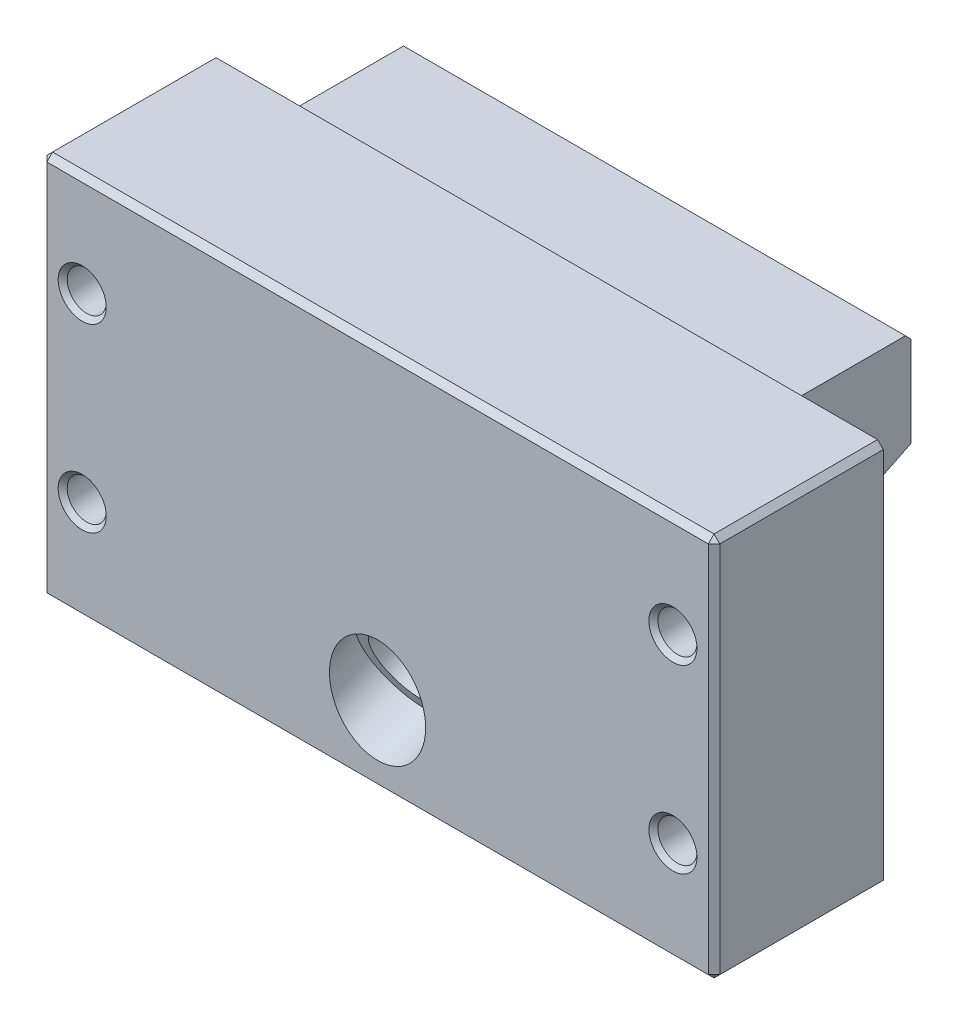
ISO-10303-21;
HEADER;
FILE_DESCRIPTION(('STEP AP214'),'2;1');
FILE_NAME('part.step','',(''),(''),'','','');
FILE_SCHEMA(('AUTOMOTIVE_DESIGN { 1 0 10303 214 1 1 1 1 }'));
ENDSEC;
DATA;
#1=APPLICATION_CONTEXT('core data for automotive mechanical design processes');
#2=APPLICATION_PROTOCOL_DEFINITION('international standard','automotive_design',2000,#1);
#3=PRODUCT_CONTEXT('',#1,'mechanical');
#4=PRODUCT('Part','Part','',(#3));
#5=PRODUCT_RELATED_PRODUCT_CATEGORY('part','',(#4));
#6=PRODUCT_DEFINITION_FORMATION('','',#4);
#7=PRODUCT_DEFINITION_CONTEXT('part definition',#1,'design');
#8=PRODUCT_DEFINITION('design','',#6,#7);
#9=PRODUCT_DEFINITION_SHAPE('','',#8);
#10=(LENGTH_UNIT() NAMED_UNIT(*) SI_UNIT(.MILLI.,.METRE.));
#11=(NAMED_UNIT(*) PLANE_ANGLE_UNIT() SI_UNIT($,.RADIAN.));
#12=(NAMED_UNIT(*) SI_UNIT($,.STERADIAN.) SOLID_ANGLE_UNIT());
#13=UNCERTAINTY_MEASURE_WITH_UNIT(LENGTH_MEASURE(1.E-05),#10,'distance_accuracy_value','');
#14=(GEOMETRIC_REPRESENTATION_CONTEXT(3) GLOBAL_UNCERTAINTY_ASSIGNED_CONTEXT((#13)) GLOBAL_UNIT_ASSIGNED_CONTEXT((#10,
#11,#12)) REPRESENTATION_CONTEXT('',''));
#15=CARTESIAN_POINT('',(0.,0.,0.));
#16=DIRECTION('',(0.,0.,1.));
#17=DIRECTION('',(1.,0.,0.));
#18=AXIS2_PLACEMENT_3D('',#15,#16,#17);
#19=CARTESIAN_POINT('',(0.,25.4,11.176));
#20=DIRECTION('',(0.,0.,-1.));
#21=DIRECTION('',(-1.,0.,0.));
#22=AXIS2_PLACEMENT_3D('',#19,#20,#21);
#23=PLANE('',#22);
#24=DIRECTION('',(0.999999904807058,-0.000436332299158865,0.));
#25=VECTOR('',#24,1.);
#26=CARTESIAN_POINT('',(-17.9197001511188,18.6683073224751,11.176));
#27=LINE('',#26,#25);
#28=CARTESIAN_POINT('',(-17.919446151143,18.6683072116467,11.176));
#29=VERTEX_POINT('',#28);
#30=CARTESIAN_POINT('',(-17.9197001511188,18.6683073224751,11.176));
#31=VERTEX_POINT('',#30);
#32=EDGE_CURVE('E394',#29,#31,#27,.F.);
#33=ORIENTED_EDGE('',*,*,#32,.F.);
#34=CARTESIAN_POINT('',(-19.5072,18.669,11.176));
#35=DIRECTION('',(0.,0.,1.));
#36=DIRECTION('',(1.,0.,0.));
#37=AXIS2_PLACEMENT_3D('',#34,#35,#36);
#38=CIRCLE('',#37,1.587754);
#39=CARTESIAN_POINT('',(-17.919446,18.669,11.176));
#40=VERTEX_POINT('',#39);
#41=EDGE_CURVE('E345',#40,#29,#38,.T.);
#42=ORIENTED_EDGE('',*,*,#41,.F.);
#43=DIRECTION('',(1.,0.,0.));
#44=VECTOR('',#43,1.);
#45=CARTESIAN_POINT('',(-17.9197,18.669,11.176));
#46=LINE('',#45,#44);
#47=CARTESIAN_POINT('',(-17.9197,18.669,11.176));
#48=VERTEX_POINT('',#47);
#49=EDGE_CURVE('E40',#40,#48,#46,.F.);
#50=ORIENTED_EDGE('',*,*,#49,.T.);
#51=CARTESIAN_POINT('',(-19.5072,18.669,11.176));
#52=DIRECTION('',(0.,0.,-1.));
#53=DIRECTION('',(-1.,0.,0.));
#54=AXIS2_PLACEMENT_3D('',#51,#52,#53);
#55=CIRCLE('',#54,1.5875);
#56=EDGE_CURVE('E401',#48,#31,#55,.T.);
#57=ORIENTED_EDGE('',*,*,#56,.T.);
#58=EDGE_LOOP('',(#33,#42,#50,#57));
#59=FACE_BOUND('',#58,.T.);
#60=DIRECTION('',(0.999999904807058,-0.000436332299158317,0.));
#61=VECTOR('',#60,1.);
#62=CARTESIAN_POINT('',(21.0946998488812,6.73030732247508,11.176));
#63=LINE('',#62,#61);
#64=CARTESIAN_POINT('',(21.094953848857,6.73030721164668,11.176));
#65=VERTEX_POINT('',#64);
#66=CARTESIAN_POINT('',(21.0946998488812,6.73030732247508,11.176));
#67=VERTEX_POINT('',#66);
#68=EDGE_CURVE('E616',#65,#67,#63,.F.);
#69=ORIENTED_EDGE('',*,*,#68,.F.);
#70=CARTESIAN_POINT('',(19.5072,6.731,11.176));
#71=DIRECTION('',(0.,0.,1.));
#72=DIRECTION('',(1.,0.,0.));
#73=AXIS2_PLACEMENT_3D('',#70,#71,#72);
#74=CIRCLE('',#73,1.587754);
#75=CARTESIAN_POINT('',(21.094954,6.731,11.176));
#76=VERTEX_POINT('',#75);
#77=EDGE_CURVE('E826',#76,#65,#74,.T.);
#78=ORIENTED_EDGE('',*,*,#77,.F.);
#79=DIRECTION('',(1.,0.,0.));
#80=VECTOR('',#79,1.);
#81=CARTESIAN_POINT('',(21.0947,6.731,11.176));
#82=LINE('',#81,#80);
#83=CARTESIAN_POINT('',(21.0947,6.731,11.176));
#84=VERTEX_POINT('',#83);
#85=EDGE_CURVE('E620',#76,#84,#82,.F.);
#86=ORIENTED_EDGE('',*,*,#85,.T.);
#87=CARTESIAN_POINT('',(19.5072,6.731,11.176));
#88=DIRECTION('',(0.,0.,-1.));
#89=DIRECTION('',(-1.,0.,0.));
#90=AXIS2_PLACEMENT_3D('',#87,#88,#89);
#91=CIRCLE('',#90,1.5875);
#92=EDGE_CURVE('E594',#84,#67,#91,.T.);
#93=ORIENTED_EDGE('',*,*,#92,.T.);
#94=EDGE_LOOP('',(#69,#78,#86,#93));
#95=FACE_BOUND('',#94,.T.);
#96=CARTESIAN_POINT('',(0.,5.16206945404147,11.176));
#97=DIRECTION('',(0.,0.,-1.));
#98=DIRECTION('',(0.,1.,0.));
#99=AXIS2_PLACEMENT_3D('',#96,#97,#98);
#100=ELLIPSE('',#99,3.44919419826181,3.175);
#101=CARTESIAN_POINT('',(0.,8.61126365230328,11.176));
#102=VERTEX_POINT('',#101);
#103=EDGE_CURVE('E526',#102,#102,#100,.F.);
#104=ORIENTED_EDGE('',*,*,#103,.F.);
#105=EDGE_LOOP('',(#104));
#106=FACE_BOUND('',#105,.T.);
#107=DIRECTION('',(0.,-1.,0.));
#108=VECTOR('',#107,1.);
#109=CARTESIAN_POINT('',(-21.844,0.,11.176));
#110=LINE('',#109,#108);
#111=CARTESIAN_POINT('',(-21.844,25.019,11.176));
#112=VERTEX_POINT('',#111);
#113=CARTESIAN_POINT('',(-21.844,0.381,11.176));
#114=VERTEX_POINT('',#113);
#115=EDGE_CURVE('E729',#112,#114,#110,.T.);
#116=ORIENTED_EDGE('',*,*,#115,.T.);
#117=DIRECTION('',(1.,0.,0.));
#118=VECTOR('',#117,1.);
#119=CARTESIAN_POINT('',(22.225,0.381,11.176));
#120=LINE('',#119,#118);
#121=CARTESIAN_POINT('',(21.844,0.381,11.176));
#122=VERTEX_POINT('',#121);
#123=EDGE_CURVE('E735',#114,#122,#120,.T.);
#124=ORIENTED_EDGE('',*,*,#123,.T.);
#125=DIRECTION('',(0.,1.,0.));
#126=VECTOR('',#125,1.);
#127=CARTESIAN_POINT('',(21.844,25.4,11.176));
#128=LINE('',#127,#126);
#129=CARTESIAN_POINT('',(21.844,25.019,11.176));
#130=VERTEX_POINT('',#129);
#131=EDGE_CURVE('E733',#122,#130,#128,.T.);
#132=ORIENTED_EDGE('',*,*,#131,.T.);
#133=DIRECTION('',(-1.,0.,0.));
#134=VECTOR('',#133,1.);
#135=CARTESIAN_POINT('',(0.,25.019,11.176));
#136=LINE('',#135,#134);
#137=EDGE_CURVE('E731',#130,#112,#136,.T.);
#138=ORIENTED_EDGE('',*,*,#137,.T.);
#139=EDGE_LOOP('',(#116,#124,#132,#138));
#140=FACE_BOUND('',#139,.T.);
#141=DIRECTION('',(0.999999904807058,-0.000436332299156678,0.));
#142=VECTOR('',#141,1.);
#143=CARTESIAN_POINT('',(21.0946998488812,18.6683073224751,11.176));
#144=LINE('',#143,#142);
#145=CARTESIAN_POINT('',(21.094953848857,18.6683072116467,11.176));
#146=VERTEX_POINT('',#145);
#147=CARTESIAN_POINT('',(21.0946998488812,18.6683073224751,11.176));
#148=VERTEX_POINT('',#147);
#149=EDGE_CURVE('E814',#146,#148,#144,.F.);
#150=ORIENTED_EDGE('',*,*,#149,.F.);
#151=CARTESIAN_POINT('',(19.5072,18.669,11.176));
#152=DIRECTION('',(0.,0.,1.));
#153=DIRECTION('',(1.,0.,0.));
#154=AXIS2_PLACEMENT_3D('',#151,#152,#153);
#155=CIRCLE('',#154,1.587754);
#156=CARTESIAN_POINT('',(21.094954,18.669,11.176));
#157=VERTEX_POINT('',#156);
#158=EDGE_CURVE('E817',#157,#146,#155,.T.);
#159=ORIENTED_EDGE('',*,*,#158,.F.);
#160=DIRECTION('',(1.,0.,0.));
#161=VECTOR('',#160,1.);
#162=CARTESIAN_POINT('',(21.0947,18.669,11.176));
#163=LINE('',#162,#161);
#164=CARTESIAN_POINT('',(21.0947,18.669,11.176));
#165=VERTEX_POINT('',#164);
#166=EDGE_CURVE('E823',#157,#165,#163,.F.);
#167=ORIENTED_EDGE('',*,*,#166,.T.);
#168=CARTESIAN_POINT('',(19.5072,18.669,11.176));
#169=DIRECTION('',(0.,0.,-1.));
#170=DIRECTION('',(-1.,0.,0.));
#171=AXIS2_PLACEMENT_3D('',#168,#169,#170);
#172=CIRCLE('',#171,1.5875);
#173=EDGE_CURVE('E601',#165,#148,#172,.T.);
#174=ORIENTED_EDGE('',*,*,#173,.T.);
#175=EDGE_LOOP('',(#150,#159,#167,#174));
#176=FACE_BOUND('',#175,.T.);
#177=DIRECTION('',(0.999999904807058,-0.000436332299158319,0.));
#178=VECTOR('',#177,1.);
#179=CARTESIAN_POINT('',(-17.9197001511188,6.73030732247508,11.176));
#180=LINE('',#179,#178);
#181=CARTESIAN_POINT('',(-17.919446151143,6.73030721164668,11.176));
#182=VERTEX_POINT('',#181);
#183=CARTESIAN_POINT('',(-17.9197001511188,6.73030732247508,11.176));
#184=VERTEX_POINT('',#183);
#185=EDGE_CURVE('E367',#182,#184,#180,.F.);
#186=ORIENTED_EDGE('',*,*,#185,.F.);
#187=CARTESIAN_POINT('',(-19.5072,6.731,11.176));
#188=DIRECTION('',(0.,0.,1.));
#189=DIRECTION('',(1.,0.,0.));
#190=AXIS2_PLACEMENT_3D('',#187,#188,#189);
#191=CIRCLE('',#190,1.587754);
#192=CARTESIAN_POINT('',(-17.919446,6.731,11.176));
#193=VERTEX_POINT('',#192);
#194=EDGE_CURVE('E429',#193,#182,#191,.T.);
#195=ORIENTED_EDGE('',*,*,#194,.F.);
#196=DIRECTION('',(1.,0.,0.));
#197=VECTOR('',#196,1.);
#198=CARTESIAN_POINT('',(-17.9197,6.731,11.176));
#199=LINE('',#198,#197);
#200=CARTESIAN_POINT('',(-17.9197,6.731,11.176));
#201=VERTEX_POINT('',#200);
#202=EDGE_CURVE('E19',#193,#201,#199,.F.);
#203=ORIENTED_EDGE('',*,*,#202,.T.);
#204=CARTESIAN_POINT('',(-19.5072,6.731,11.176));
#205=DIRECTION('',(0.,0.,-1.));
#206=DIRECTION('',(-1.,0.,0.));
#207=AXIS2_PLACEMENT_3D('',#204,#205,#206);
#208=CIRCLE('',#207,1.5875);
#209=EDGE_CURVE('E397',#201,#184,#208,.T.);
#210=ORIENTED_EDGE('',*,*,#209,.T.);
#211=EDGE_LOOP('',(#186,#195,#203,#210));
#212=FACE_BOUND('',#211,.T.);
#213=ADVANCED_FACE('F15',(#59,#95,#106,#140,#176,#212),#23,.F.);
#214=CARTESIAN_POINT('',(19.5072,6.731,3.4417));
#215=DIRECTION('',(0.,0.,1.));
#216=DIRECTION('',(1.,0.,0.));
#217=AXIS2_PLACEMENT_3D('',#214,#215,#216);
#218=CYLINDRICAL_SURFACE('',#217,1.28905);
#219=CARTESIAN_POINT('',(19.5072,6.731,10.87755));
#220=DIRECTION('',(0.,0.,-1.));
#221=DIRECTION('',(-1.,0.,0.));
#222=AXIS2_PLACEMENT_3D('',#219,#220,#221);
#223=CIRCLE('',#222,1.28905);
#224=CARTESIAN_POINT('',(18.21815,6.731,10.87755));
#225=VERTEX_POINT('',#224);
#226=EDGE_CURVE('E9',#225,#225,#223,.F.);
#227=ORIENTED_EDGE('',*,*,#226,.T.);
#228=EDGE_LOOP('',(#227));
#229=FACE_BOUND('',#228,.T.);
#230=CARTESIAN_POINT('',(19.5072,6.731,3.8608));
#231=DIRECTION('',(0.,0.,-1.));
#232=DIRECTION('',(-1.,0.,0.));
#233=AXIS2_PLACEMENT_3D('',#230,#231,#232);
#234=CIRCLE('',#233,1.28905);
#235=CARTESIAN_POINT('',(18.21815,6.731,3.8608));
#236=VERTEX_POINT('',#235);
#237=EDGE_CURVE('E642',#236,#236,#234,.T.);
#238=ORIENTED_EDGE('',*,*,#237,.T.);
#239=EDGE_LOOP('',(#238));
#240=FACE_BOUND('',#239,.T.);
#241=ADVANCED_FACE('F466',(#229,#240),#218,.F.);
#242=CARTESIAN_POINT('',(-19.5072,6.731,3.4417));
#243=DIRECTION('',(0.,0.,1.));
#244=DIRECTION('',(1.,0.,0.));
#245=AXIS2_PLACEMENT_3D('',#242,#243,#244);
#246=CYLINDRICAL_SURFACE('',#245,1.28905);
#247=CARTESIAN_POINT('',(-19.5072,6.731,10.87755));
#248=DIRECTION('',(0.,0.,-1.));
#249=DIRECTION('',(-1.,0.,0.));
#250=AXIS2_PLACEMENT_3D('',#247,#248,#249);
#251=CIRCLE('',#250,1.28905);
#252=CARTESIAN_POINT('',(-20.79625,6.731,10.87755));
#253=VERTEX_POINT('',#252);
#254=EDGE_CURVE('E589',#253,#253,#251,.F.);
#255=ORIENTED_EDGE('',*,*,#254,.T.);
#256=EDGE_LOOP('',(#255));
#257=FACE_BOUND('',#256,.T.);
#258=CARTESIAN_POINT('',(-19.5072,6.731,3.8608));
#259=DIRECTION('',(0.,0.,-1.));
#260=DIRECTION('',(-1.,0.,0.));
#261=AXIS2_PLACEMENT_3D('',#258,#259,#260);
#262=CIRCLE('',#261,1.28905);
#263=CARTESIAN_POINT('',(-20.79625,6.731,3.8608));
#264=VERTEX_POINT('',#263);
#265=EDGE_CURVE('E619',#264,#264,#262,.T.);
#266=ORIENTED_EDGE('',*,*,#265,.T.);
#267=EDGE_LOOP('',(#266));
#268=FACE_BOUND('',#267,.T.);
#269=ADVANCED_FACE('F472',(#257,#268),#246,.F.);
#270=CARTESIAN_POINT('',(-19.5072,18.669,3.4417));
#271=DIRECTION('',(0.,0.,1.));
#272=DIRECTION('',(1.,0.,0.));
#273=AXIS2_PLACEMENT_3D('',#270,#271,#272);
#274=CYLINDRICAL_SURFACE('',#273,1.28905);
#275=CARTESIAN_POINT('',(-19.5072,18.669,10.87755));
#276=DIRECTION('',(0.,0.,-1.));
#277=DIRECTION('',(-1.,0.,0.));
#278=AXIS2_PLACEMENT_3D('',#275,#276,#277);
#279=CIRCLE('',#278,1.28905);
#280=CARTESIAN_POINT('',(-20.79625,18.669,10.87755));
#281=VERTEX_POINT('',#280);
#282=EDGE_CURVE('E400',#281,#281,#279,.F.);
#283=ORIENTED_EDGE('',*,*,#282,.T.);
#284=EDGE_LOOP('',(#283));
#285=FACE_BOUND('',#284,.T.);
#286=CARTESIAN_POINT('',(-19.5072,18.669,3.8608));
#287=DIRECTION('',(0.,0.,-1.));
#288=DIRECTION('',(-1.,0.,0.));
#289=AXIS2_PLACEMENT_3D('',#286,#287,#288);
#290=CIRCLE('',#289,1.28905);
#291=CARTESIAN_POINT('',(-20.79625,18.669,3.8608));
#292=VERTEX_POINT('',#291);
#293=EDGE_CURVE('E639',#292,#292,#290,.T.);
#294=ORIENTED_EDGE('',*,*,#293,.T.);
#295=EDGE_LOOP('',(#294));
#296=FACE_BOUND('',#295,.T.);
#297=ADVANCED_FACE('F502',(#285,#296),#274,.F.);
#298=CARTESIAN_POINT('',(-16.5735,25.4,0.));
#299=DIRECTION('',(-1.,0.,0.));
#300=DIRECTION('',(0.,0.,1.));
#301=AXIS2_PLACEMENT_3D('',#298,#299,#300);
#302=PLANE('',#301);
#303=DIRECTION('',(0.,-1.,0.));
#304=VECTOR('',#303,1.);
#305=CARTESIAN_POINT('',(-16.5735,18.9915361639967,-7.493));
#306=LINE('',#305,#304);
#307=CARTESIAN_POINT('',(-16.5735,24.765,-7.493));
#308=VERTEX_POINT('',#307);
#309=CARTESIAN_POINT('',(-16.5735,18.8077752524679,-7.493));
#310=VERTEX_POINT('',#309);
#311=EDGE_CURVE('E549',#308,#310,#306,.T.);
#312=ORIENTED_EDGE('',*,*,#311,.T.);
#313=CARTESIAN_POINT('',(-16.5735,19.4676866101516,-7.112));
#314=DIRECTION('',(-1.,0.,0.));
#315=DIRECTION('',(0.,0.,1.));
#316=AXIS2_PLACEMENT_3D('',#313,#314,#315);
#317=CIRCLE('',#316,0.762);
#318=CARTESIAN_POINT('',(-16.5735,18.7828055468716,-7.44603881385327));
#319=VERTEX_POINT('',#318);
#320=EDGE_CURVE('E568',#310,#319,#317,.T.);
#321=ORIENTED_EDGE('',*,*,#320,.T.);
#322=DIRECTION('',(0.,0.438371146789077,-0.898794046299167));
#323=VECTOR('',#322,1.);
#324=CARTESIAN_POINT('',(-16.5735,17.1206475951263,-4.03810998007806));
#325=LINE('',#324,#323);
#326=CARTESIAN_POINT('',(-16.5735,15.6033794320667,-0.927249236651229));
#327=VERTEX_POINT('',#326);
#328=EDGE_CURVE('E690',#327,#319,#325,.T.);
#329=ORIENTED_EDGE('',*,*,#328,.F.);
#330=CARTESIAN_POINT('',(-16.5735,14.1194704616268,-1.651));
#331=DIRECTION('',(-1.,0.,0.));
#332=DIRECTION('',(0.,0.,1.));
#333=AXIS2_PLACEMENT_3D('',#330,#331,#332);
#334=CIRCLE('',#333,1.651);
#335=CARTESIAN_POINT('',(-16.5735,14.1194704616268,0.));
#336=VERTEX_POINT('',#335);
#337=EDGE_CURVE('E584',#327,#336,#334,.F.);
#338=ORIENTED_EDGE('',*,*,#337,.T.);
#339=DIRECTION('',(0.,-1.,0.));
#340=VECTOR('',#339,1.);
#341=CARTESIAN_POINT('',(-16.5735,25.4,0.));
#342=LINE('',#341,#340);
#343=CARTESIAN_POINT('',(-16.5735,25.146,0.));
#344=VERTEX_POINT('',#343);
#345=EDGE_CURVE('E702',#344,#336,#342,.T.);
#346=ORIENTED_EDGE('',*,*,#345,.F.);
#347=DIRECTION('',(0.,0.,1.));
#348=VECTOR('',#347,1.);
#349=CARTESIAN_POINT('',(-16.5735,25.146,-7.874));
#350=LINE('',#349,#348);
#351=CARTESIAN_POINT('',(-16.5735,25.146,-7.112));
#352=VERTEX_POINT('',#351);
#353=EDGE_CURVE('E652',#352,#344,#350,.T.);
#354=ORIENTED_EDGE('',*,*,#353,.F.);
#355=DIRECTION('',(0.,-0.707106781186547,-0.707106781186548));
#356=VECTOR('',#355,1.);
#357=CARTESIAN_POINT('',(-16.5735,28.829,-3.429));
#358=LINE('',#357,#356);
#359=EDGE_CURVE('E541',#352,#308,#358,.T.);
#360=ORIENTED_EDGE('',*,*,#359,.T.);
#361=EDGE_LOOP('',(#312,#321,#329,#338,#346,#354,#360));
#362=FACE_BOUND('',#361,.T.);
#363=ADVANCED_FACE('F495',(#362),#302,.T.);
#364=CARTESIAN_POINT('',(16.5735,25.4,0.));
#365=DIRECTION('',(-1.,0.,0.));
#366=DIRECTION('',(0.,0.,1.));
#367=AXIS2_PLACEMENT_3D('',#364,#365,#366);
#368=PLANE('',#367);
#369=DIRECTION('',(0.,-1.,0.));
#370=VECTOR('',#369,1.);
#371=CARTESIAN_POINT('',(16.5735,25.4,0.));
#372=LINE('',#371,#370);
#373=CARTESIAN_POINT('',(16.5735,25.146,0.));
#374=VERTEX_POINT('',#373);
#375=CARTESIAN_POINT('',(16.5735,14.1194704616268,0.));
#376=VERTEX_POINT('',#375);
#377=EDGE_CURVE('E704',#374,#376,#372,.T.);
#378=ORIENTED_EDGE('',*,*,#377,.T.);
#379=CARTESIAN_POINT('',(16.5735,14.1194704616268,-1.651));
#380=DIRECTION('',(-1.,0.,0.));
#381=DIRECTION('',(0.,0.,1.));
#382=AXIS2_PLACEMENT_3D('',#379,#380,#381);
#383=CIRCLE('',#382,1.651);
#384=CARTESIAN_POINT('',(16.5735,15.6033794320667,-0.927249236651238));
#385=VERTEX_POINT('',#384);
#386=EDGE_CURVE('E587',#376,#385,#383,.T.);
#387=ORIENTED_EDGE('',*,*,#386,.T.);
#388=DIRECTION('',(0.,0.438371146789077,-0.898794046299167));
#389=VECTOR('',#388,1.);
#390=CARTESIAN_POINT('',(16.5735,17.1206475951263,-4.03810998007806));
#391=LINE('',#390,#389);
#392=CARTESIAN_POINT('',(16.5735,18.7828055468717,-7.44603881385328));
#393=VERTEX_POINT('',#392);
#394=EDGE_CURVE('E530',#385,#393,#391,.T.);
#395=ORIENTED_EDGE('',*,*,#394,.T.);
#396=CARTESIAN_POINT('',(16.5735,19.4676866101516,-7.112));
#397=DIRECTION('',(-1.,0.,0.));
#398=DIRECTION('',(0.,0.,1.));
#399=AXIS2_PLACEMENT_3D('',#396,#397,#398);
#400=CIRCLE('',#399,0.762);
#401=CARTESIAN_POINT('',(16.5735,18.8077752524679,-7.493));
#402=VERTEX_POINT('',#401);
#403=EDGE_CURVE('E574',#393,#402,#400,.F.);
#404=ORIENTED_EDGE('',*,*,#403,.T.);
#405=DIRECTION('',(0.,1.,0.));
#406=VECTOR('',#405,1.);
#407=CARTESIAN_POINT('',(16.5735,25.4,-7.493));
#408=LINE('',#407,#406);
#409=CARTESIAN_POINT('',(16.5735,24.765,-7.493));
#410=VERTEX_POINT('',#409);
#411=EDGE_CURVE('E561',#402,#410,#408,.T.);
#412=ORIENTED_EDGE('',*,*,#411,.T.);
#413=DIRECTION('',(0.,0.707106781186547,0.707106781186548));
#414=VECTOR('',#413,1.);
#415=CARTESIAN_POINT('',(16.5735,25.146,-7.112));
#416=LINE('',#415,#414);
#417=CARTESIAN_POINT('',(16.5735,25.146,-7.112));
#418=VERTEX_POINT('',#417);
#419=EDGE_CURVE('E547',#410,#418,#416,.T.);
#420=ORIENTED_EDGE('',*,*,#419,.T.);
#421=DIRECTION('',(0.,0.,1.));
#422=VECTOR('',#421,1.);
#423=CARTESIAN_POINT('',(16.5735,25.146,-7.874));
#424=LINE('',#423,#422);
#425=EDGE_CURVE('E651',#418,#374,#424,.T.);
#426=ORIENTED_EDGE('',*,*,#425,.T.);
#427=EDGE_LOOP('',(#378,#387,#395,#404,#412,#420,#426));
#428=FACE_BOUND('',#427,.T.);
#429=ADVANCED_FACE('F491',(#428),#368,.F.);
#430=CARTESIAN_POINT('',(16.5735,25.4,-7.874));
#431=DIRECTION('',(0.,0.,1.));
#432=DIRECTION('',(1.,0.,0.));
#433=AXIS2_PLACEMENT_3D('',#430,#431,#432);
#434=PLANE('',#433);
#435=DIRECTION('',(0.,-1.,0.));
#436=VECTOR('',#435,1.);
#437=CARTESIAN_POINT('',(16.1925,25.4,-7.874));
#438=LINE('',#437,#436);
#439=CARTESIAN_POINT('',(16.1925,24.384,-7.874));
#440=VERTEX_POINT('',#439);
#441=CARTESIAN_POINT('',(16.1925,19.4676866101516,-7.874));
#442=VERTEX_POINT('',#441);
#443=EDGE_CURVE('E552',#440,#442,#438,.T.);
#444=ORIENTED_EDGE('',*,*,#443,.T.);
#445=DIRECTION('',(-1.,0.,0.));
#446=VECTOR('',#445,1.);
#447=CARTESIAN_POINT('',(16.5735,19.4676866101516,-7.874));
#448=LINE('',#447,#446);
#449=CARTESIAN_POINT('',(-16.1925,19.4676866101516,-7.874));
#450=VERTEX_POINT('',#449);
#451=EDGE_CURVE('E563',#442,#450,#448,.T.);
#452=ORIENTED_EDGE('',*,*,#451,.T.);
#453=DIRECTION('',(0.,1.,0.));
#454=VECTOR('',#453,1.);
#455=CARTESIAN_POINT('',(-16.1925,24.384,-7.874));
#456=LINE('',#455,#454);
#457=CARTESIAN_POINT('',(-16.1925,24.384,-7.874));
#458=VERTEX_POINT('',#457);
#459=EDGE_CURVE('E555',#450,#458,#456,.T.);
#460=ORIENTED_EDGE('',*,*,#459,.T.);
#461=DIRECTION('',(1.,0.,0.));
#462=VECTOR('',#461,1.);
#463=CARTESIAN_POINT('',(16.5735,24.384,-7.874));
#464=LINE('',#463,#462);
#465=EDGE_CURVE('E544',#458,#440,#464,.T.);
#466=ORIENTED_EDGE('',*,*,#465,.T.);
#467=EDGE_LOOP('',(#444,#452,#460,#466));
#468=FACE_BOUND('',#467,.T.);
#469=ADVANCED_FACE('F494',(#468),#434,.F.);
#470=CARTESIAN_POINT('',(-22.225,25.4,11.176));
#471=DIRECTION('',(0.,-1.,0.));
#472=DIRECTION('',(0.,0.,-1.));
#473=AXIS2_PLACEMENT_3D('',#470,#471,#472);
#474=PLANE('',#473);
#475=DIRECTION('',(-1.,0.,0.));
#476=VECTOR('',#475,1.);
#477=CARTESIAN_POINT('',(22.225,25.4,0.));
#478=LINE('',#477,#476);
#479=CARTESIAN_POINT('',(21.844,25.4,0.));
#480=VERTEX_POINT('',#479);
#481=CARTESIAN_POINT('',(-21.844,25.4,0.));
#482=VERTEX_POINT('',#481);
#483=EDGE_CURVE('E695',#480,#482,#478,.T.);
#484=ORIENTED_EDGE('',*,*,#483,.T.);
#485=DIRECTION('',(0.,0.,1.));
#486=VECTOR('',#485,1.);
#487=CARTESIAN_POINT('',(-21.844,25.4,11.176));
#488=LINE('',#487,#486);
#489=CARTESIAN_POINT('',(-21.844,25.4,10.795));
#490=VERTEX_POINT('',#489);
#491=EDGE_CURVE('E744',#482,#490,#488,.T.);
#492=ORIENTED_EDGE('',*,*,#491,.T.);
#493=DIRECTION('',(1.,0.,0.));
#494=VECTOR('',#493,1.);
#495=CARTESIAN_POINT('',(-22.225,25.4,10.795));
#496=LINE('',#495,#494);
#497=CARTESIAN_POINT('',(21.844,25.4,10.795));
#498=VERTEX_POINT('',#497);
#499=EDGE_CURVE('E745',#490,#498,#496,.T.);
#500=ORIENTED_EDGE('',*,*,#499,.T.);
#501=DIRECTION('',(0.,0.,-1.));
#502=VECTOR('',#501,1.);
#503=CARTESIAN_POINT('',(21.844,25.4,11.176));
#504=LINE('',#503,#502);
#505=EDGE_CURVE('E536',#498,#480,#504,.T.);
#506=ORIENTED_EDGE('',*,*,#505,.T.);
#507=EDGE_LOOP('',(#484,#492,#500,#506));
#508=FACE_BOUND('',#507,.T.);
#509=ADVANCED_FACE('F479',(#508),#474,.F.);
#510=CARTESIAN_POINT('',(-22.225,0.,11.176));
#511=DIRECTION('',(0.,-1.,0.));
#512=DIRECTION('',(0.,0.,-1.));
#513=AXIS2_PLACEMENT_3D('',#510,#511,#512);
#514=PLANE('',#513);
#515=DIRECTION('',(-1.,0.,0.));
#516=VECTOR('',#515,1.);
#517=CARTESIAN_POINT('',(-22.225,0.,10.795));
#518=LINE('',#517,#516);
#519=CARTESIAN_POINT('',(21.844,0.,10.795));
#520=VERTEX_POINT('',#519);
#521=CARTESIAN_POINT('',(-21.844,0.,10.795));
#522=VERTEX_POINT('',#521);
#523=EDGE_CURVE('E709',#520,#522,#518,.T.);
#524=ORIENTED_EDGE('',*,*,#523,.T.);
#525=DIRECTION('',(0.,0.,-1.));
#526=VECTOR('',#525,1.);
#527=CARTESIAN_POINT('',(-21.844,0.,11.176));
#528=LINE('',#527,#526);
#529=CARTESIAN_POINT('',(-21.844,0.,0.));
#530=VERTEX_POINT('',#529);
#531=EDGE_CURVE('E711',#522,#530,#528,.T.);
#532=ORIENTED_EDGE('',*,*,#531,.T.);
#533=DIRECTION('',(-1.,0.,0.));
#534=VECTOR('',#533,1.);
#535=CARTESIAN_POINT('',(22.225,0.,0.));
#536=LINE('',#535,#534);
#537=CARTESIAN_POINT('',(21.844,0.,0.));
#538=VERTEX_POINT('',#537);
#539=EDGE_CURVE('E692',#538,#530,#536,.T.);
#540=ORIENTED_EDGE('',*,*,#539,.F.);
#541=DIRECTION('',(0.,0.,1.));
#542=VECTOR('',#541,1.);
#543=CARTESIAN_POINT('',(21.844,0.,11.176));
#544=LINE('',#543,#542);
#545=EDGE_CURVE('E701',#538,#520,#544,.T.);
#546=ORIENTED_EDGE('',*,*,#545,.T.);
#547=EDGE_LOOP('',(#524,#532,#540,#546));
#548=FACE_BOUND('',#547,.T.);
#549=ADVANCED_FACE('F505',(#548),#514,.T.);
#550=CARTESIAN_POINT('',(-22.225,25.4,11.176));
#551=DIRECTION('',(-1.,0.,0.));
#552=DIRECTION('',(0.,0.,1.));
#553=AXIS2_PLACEMENT_3D('',#550,#551,#552);
#554=PLANE('',#553);
#555=DIRECTION('',(0.,-1.,0.));
#556=VECTOR('',#555,1.);
#557=CARTESIAN_POINT('',(-22.225,25.4,0.));
#558=LINE('',#557,#556);
#559=CARTESIAN_POINT('',(-22.225,25.019,0.));
#560=VERTEX_POINT('',#559);
#561=CARTESIAN_POINT('',(-22.225,0.381,0.));
#562=VERTEX_POINT('',#561);
#563=EDGE_CURVE('E698',#560,#562,#558,.T.);
#564=ORIENTED_EDGE('',*,*,#563,.T.);
#565=DIRECTION('',(0.,0.,1.));
#566=VECTOR('',#565,1.);
#567=CARTESIAN_POINT('',(-22.225,0.381,11.176));
#568=LINE('',#567,#566);
#569=CARTESIAN_POINT('',(-22.225,0.381,10.795));
#570=VERTEX_POINT('',#569);
#571=EDGE_CURVE('E727',#562,#570,#568,.T.);
#572=ORIENTED_EDGE('',*,*,#571,.T.);
#573=DIRECTION('',(0.,1.,0.));
#574=VECTOR('',#573,1.);
#575=CARTESIAN_POINT('',(-22.225,25.4,10.795));
#576=LINE('',#575,#574);
#577=CARTESIAN_POINT('',(-22.225,25.019,10.795));
#578=VERTEX_POINT('',#577);
#579=EDGE_CURVE('E725',#570,#578,#576,.T.);
#580=ORIENTED_EDGE('',*,*,#579,.T.);
#581=DIRECTION('',(0.,0.,-1.));
#582=VECTOR('',#581,1.);
#583=CARTESIAN_POINT('',(-22.225,25.019,0.));
#584=LINE('',#583,#582);
#585=EDGE_CURVE('E723',#578,#560,#584,.T.);
#586=ORIENTED_EDGE('',*,*,#585,.T.);
#587=EDGE_LOOP('',(#564,#572,#580,#586));
#588=FACE_BOUND('',#587,.T.);
#589=ADVANCED_FACE('F489',(#588),#554,.T.);
#590=CARTESIAN_POINT('',(22.225,25.4,0.));
#591=DIRECTION('',(0.,0.,1.));
#592=DIRECTION('',(1.,0.,0.));
#593=AXIS2_PLACEMENT_3D('',#590,#591,#592);
#594=PLANE('',#593);
#595=ORIENTED_EDGE('',*,*,#345,.T.);
#596=DIRECTION('',(-1.,0.,0.));
#597=VECTOR('',#596,1.);
#598=CARTESIAN_POINT('',(16.5735,14.1194704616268,0.));
#599=LINE('',#598,#597);
#600=EDGE_CURVE('E581',#336,#376,#599,.F.);
#601=ORIENTED_EDGE('',*,*,#600,.T.);
#602=ORIENTED_EDGE('',*,*,#377,.F.);
#603=DIRECTION('',(1.,0.,0.));
#604=VECTOR('',#603,1.);
#605=CARTESIAN_POINT('',(16.5735,25.146,0.));
#606=LINE('',#605,#604);
#607=EDGE_CURVE('E648',#374,#344,#606,.F.);
#608=ORIENTED_EDGE('',*,*,#607,.T.);
#609=EDGE_LOOP('',(#595,#601,#602,#608));
#610=FACE_BOUND('',#609,.T.);
#611=CARTESIAN_POINT('',(0.,9.906,0.));
#612=DIRECTION('',(0.,0.,1.));
#613=DIRECTION('',(0.,-1.,0.));
#614=AXIS2_PLACEMENT_3D('',#611,#612,#613);
#615=ELLIPSE('',#614,2.58689564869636,2.38125);
#616=CARTESIAN_POINT('',(0.,7.31910435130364,0.));
#617=VERTEX_POINT('',#616);
#618=EDGE_CURVE('E527',#617,#617,#615,.T.);
#619=ORIENTED_EDGE('',*,*,#618,.T.);
#620=EDGE_LOOP('',(#619));
#621=FACE_BOUND('',#620,.T.);
#622=ORIENTED_EDGE('',*,*,#539,.T.);
#623=DIRECTION('',(0.707106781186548,-0.707106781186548,0.));
#624=VECTOR('',#623,1.);
#625=CARTESIAN_POINT('',(-21.844,0.,0.));
#626=LINE('',#625,#624);
#627=EDGE_CURVE('E721',#530,#562,#626,.F.);
#628=ORIENTED_EDGE('',*,*,#627,.T.);
#629=ORIENTED_EDGE('',*,*,#563,.F.);
#630=DIRECTION('',(0.707106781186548,0.707106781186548,0.));
#631=VECTOR('',#630,1.);
#632=CARTESIAN_POINT('',(-22.225,25.019,0.));
#633=LINE('',#632,#631);
#634=EDGE_CURVE('E714',#560,#482,#633,.T.);
#635=ORIENTED_EDGE('',*,*,#634,.T.);
#636=ORIENTED_EDGE('',*,*,#483,.F.);
#637=DIRECTION('',(-0.707106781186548,0.707106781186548,0.));
#638=VECTOR('',#637,1.);
#639=CARTESIAN_POINT('',(21.844,25.4,0.));
#640=LINE('',#639,#638);
#641=CARTESIAN_POINT('',(22.225,25.019,0.));
#642=VERTEX_POINT('',#641);
#643=EDGE_CURVE('E717',#480,#642,#640,.F.);
#644=ORIENTED_EDGE('',*,*,#643,.T.);
#645=DIRECTION('',(0.,-1.,0.));
#646=VECTOR('',#645,1.);
#647=CARTESIAN_POINT('',(22.225,25.4,0.));
#648=LINE('',#647,#646);
#649=CARTESIAN_POINT('',(22.225,0.381000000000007,0.));
#650=VERTEX_POINT('',#649);
#651=EDGE_CURVE('E697',#642,#650,#648,.T.);
#652=ORIENTED_EDGE('',*,*,#651,.T.);
#653=DIRECTION('',(-0.707106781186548,-0.707106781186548,0.));
#654=VECTOR('',#653,1.);
#655=CARTESIAN_POINT('',(22.225,0.381,0.));
#656=LINE('',#655,#654);
#657=EDGE_CURVE('E719',#650,#538,#656,.T.);
#658=ORIENTED_EDGE('',*,*,#657,.T.);
#659=EDGE_LOOP('',(#622,#628,#629,#635,#636,#644,#652,#658));
#660=FACE_BOUND('',#659,.T.);
#661=ADVANCED_FACE('F485',(#610,#621,#660),#594,.F.);
#662=CARTESIAN_POINT('',(22.225,25.4,11.176));
#663=DIRECTION('',(-1.,0.,0.));
#664=DIRECTION('',(0.,0.,1.));
#665=AXIS2_PLACEMENT_3D('',#662,#663,#664);
#666=PLANE('',#665);
#667=DIRECTION('',(0.,-1.,0.));
#668=VECTOR('',#667,1.);
#669=CARTESIAN_POINT('',(22.225,25.4,10.795));
#670=LINE('',#669,#668);
#671=CARTESIAN_POINT('',(22.225,25.019,10.795));
#672=VERTEX_POINT('',#671);
#673=CARTESIAN_POINT('',(22.225,0.381,10.795));
#674=VERTEX_POINT('',#673);
#675=EDGE_CURVE('E738',#672,#674,#670,.T.);
#676=ORIENTED_EDGE('',*,*,#675,.T.);
#677=DIRECTION('',(0.,0.,-1.));
#678=VECTOR('',#677,1.);
#679=CARTESIAN_POINT('',(22.225,0.381,0.));
#680=LINE('',#679,#678);
#681=EDGE_CURVE('E742',#674,#650,#680,.T.);
#682=ORIENTED_EDGE('',*,*,#681,.T.);
#683=ORIENTED_EDGE('',*,*,#651,.F.);
#684=DIRECTION('',(0.,0.,1.));
#685=VECTOR('',#684,1.);
#686=CARTESIAN_POINT('',(22.225,25.019,11.176));
#687=LINE('',#686,#685);
#688=EDGE_CURVE('E740',#642,#672,#687,.T.);
#689=ORIENTED_EDGE('',*,*,#688,.T.);
#690=EDGE_LOOP('',(#676,#682,#683,#689));
#691=FACE_BOUND('',#690,.T.);
#692=ADVANCED_FACE('F481',(#691),#666,.F.);
#693=CARTESIAN_POINT('',(115.905956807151,15.1511297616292,0.));
#694=DIRECTION('',(0.,0.898794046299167,0.438371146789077));
#695=DIRECTION('',(0.,-0.438371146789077,0.898794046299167));
#696=AXIS2_PLACEMENT_3D('',#693,#694,#695);
#697=PLANE('',#696);
#698=ORIENTED_EDGE('',*,*,#394,.F.);
#699=DIRECTION('',(-1.,0.,0.));
#700=VECTOR('',#699,1.);
#701=CARTESIAN_POINT('',(-16.5735,15.6033794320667,-0.927249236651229));
#702=LINE('',#701,#700);
#703=EDGE_CURVE('E578',#385,#327,#702,.T.);
#704=ORIENTED_EDGE('',*,*,#703,.T.);
#705=ORIENTED_EDGE('',*,*,#328,.T.);
#706=DIRECTION('',(-1.,0.,0.));
#707=VECTOR('',#706,1.);
#708=CARTESIAN_POINT('',(115.905956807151,18.7828055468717,-7.44603881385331));
#709=LINE('',#708,#707);
#710=EDGE_CURVE('E571',#319,#393,#709,.F.);
#711=ORIENTED_EDGE('',*,*,#710,.T.);
#712=EDGE_LOOP('',(#698,#704,#705,#711));
#713=FACE_BOUND('',#712,.T.);
#714=ADVANCED_FACE('F484',(#713),#697,.F.);
#715=CARTESIAN_POINT('',(0.,-3.94328611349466,32.6268734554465));
#716=DIRECTION('',(0.,0.390731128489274,-0.92050485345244));
#717=DIRECTION('',(0.,0.92050485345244,0.390731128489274));
#718=AXIS2_PLACEMENT_3D('',#715,#716,#717);
#719=CYLINDRICAL_SURFACE('',#718,3.175);
#720=CARTESIAN_POINT('',(0.,5.98525437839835,9.23669784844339));
#721=DIRECTION('',(0.,-0.390731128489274,0.920504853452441));
#722=DIRECTION('',(0.,-0.92050485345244,-0.390731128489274));
#723=AXIS2_PLACEMENT_3D('',#720,#721,#722);
#724=CIRCLE('',#723,3.175);
#725=CARTESIAN_POINT('',(0.,3.06265146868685,7.99612651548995));
#726=VERTEX_POINT('',#725);
#727=EDGE_CURVE('E525',#726,#726,#724,.T.);
#728=ORIENTED_EDGE('',*,*,#727,.F.);
#729=EDGE_LOOP('',(#728));
#730=FACE_BOUND('',#729,.T.);
#731=ORIENTED_EDGE('',*,*,#103,.T.);
#732=EDGE_LOOP('',(#731));
#733=FACE_BOUND('',#732,.T.);
#734=ADVANCED_FACE('F509',(#730,#733),#719,.F.);
#735=CARTESIAN_POINT('',(0.,5.98525437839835,9.23669784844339));
#736=DIRECTION('',(0.,-0.390731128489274,0.920504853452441));
#737=DIRECTION('',(0.,-0.92050485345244,-0.390731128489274));
#738=AXIS2_PLACEMENT_3D('',#735,#736,#737);
#739=PLANE('',#738);
#740=CARTESIAN_POINT('',(0.,5.98525437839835,9.2366978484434));
#741=DIRECTION('',(0.,-0.390731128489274,0.920504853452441));
#742=DIRECTION('',(0.,-0.92050485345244,-0.390731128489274));
#743=AXIS2_PLACEMENT_3D('',#740,#741,#742);
#744=CIRCLE('',#743,2.38125);
#745=CARTESIAN_POINT('',(0.,3.79330219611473,8.30626934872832));
#746=VERTEX_POINT('',#745);
#747=EDGE_CURVE('E522',#746,#746,#744,.T.);
#748=ORIENTED_EDGE('',*,*,#747,.F.);
#749=EDGE_LOOP('',(#748));
#750=FACE_BOUND('',#749,.T.);
#751=ORIENTED_EDGE('',*,*,#727,.T.);
#752=EDGE_LOOP('',(#751));
#753=FACE_BOUND('',#752,.T.);
#754=ADVANCED_FACE('F507',(#750,#753),#739,.T.);
#755=CARTESIAN_POINT('',(0.,15.9058552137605,-14.1347730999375));
#756=DIRECTION('',(0.,-0.390731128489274,0.92050485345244));
#757=DIRECTION('',(0.,-0.92050485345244,-0.390731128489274));
#758=AXIS2_PLACEMENT_3D('',#755,#756,#757);
#759=CYLINDRICAL_SURFACE('',#758,2.38125);
#760=ORIENTED_EDGE('',*,*,#747,.T.);
#761=EDGE_LOOP('',(#760));
#762=FACE_BOUND('',#761,.T.);
#763=ORIENTED_EDGE('',*,*,#618,.F.);
#764=EDGE_LOOP('',(#763));
#765=FACE_BOUND('',#764,.T.);
#766=ADVANCED_FACE('F17',(#762,#765),#759,.F.);
#767=CARTESIAN_POINT('',(19.5072,18.669,3.4417));
#768=DIRECTION('',(0.,0.,1.));
#769=DIRECTION('',(1.,0.,0.));
#770=AXIS2_PLACEMENT_3D('',#767,#768,#769);
#771=CYLINDRICAL_SURFACE('',#770,1.28905);
#772=CARTESIAN_POINT('',(19.5072,18.669,10.87755));
#773=DIRECTION('',(0.,0.,-1.));
#774=DIRECTION('',(-1.,0.,0.));
#775=AXIS2_PLACEMENT_3D('',#772,#773,#774);
#776=CIRCLE('',#775,1.28905);
#777=CARTESIAN_POINT('',(18.21815,18.669,10.87755));
#778=VERTEX_POINT('',#777);
#779=EDGE_CURVE('E25',#778,#778,#776,.F.);
#780=ORIENTED_EDGE('',*,*,#779,.T.);
#781=EDGE_LOOP('',(#780));
#782=FACE_BOUND('',#781,.T.);
#783=CARTESIAN_POINT('',(19.5072,18.669,3.8608));
#784=DIRECTION('',(0.,0.,-1.));
#785=DIRECTION('',(-1.,0.,0.));
#786=AXIS2_PLACEMENT_3D('',#783,#784,#785);
#787=CIRCLE('',#786,1.28905);
#788=CARTESIAN_POINT('',(18.21815,18.669,3.8608));
#789=VERTEX_POINT('',#788);
#790=EDGE_CURVE('E645',#789,#789,#787,.T.);
#791=ORIENTED_EDGE('',*,*,#790,.T.);
#792=EDGE_LOOP('',(#791));
#793=FACE_BOUND('',#792,.T.);
#794=ADVANCED_FACE('F515',(#782,#793),#771,.F.);
#795=CARTESIAN_POINT('',(21.844,25.4,11.176));
#796=DIRECTION('',(-0.707106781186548,-0.707106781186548,0.));
#797=DIRECTION('',(0.707106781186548,-0.707106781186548,0.));
#798=AXIS2_PLACEMENT_3D('',#795,#796,#797);
#799=PLANE('',#798);
#800=DIRECTION('',(0.707106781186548,-0.707106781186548,0.));
#801=VECTOR('',#800,1.);
#802=CARTESIAN_POINT('',(22.225,25.019,10.795));
#803=LINE('',#802,#801);
#804=EDGE_CURVE('E590',#672,#498,#803,.F.);
#805=ORIENTED_EDGE('',*,*,#804,.F.);
#806=ORIENTED_EDGE('',*,*,#688,.F.);
#807=ORIENTED_EDGE('',*,*,#643,.F.);
#808=ORIENTED_EDGE('',*,*,#505,.F.);
#809=EDGE_LOOP('',(#805,#806,#807,#808));
#810=FACE_BOUND('',#809,.T.);
#811=ADVANCED_FACE('F759',(#810),#799,.F.);
#812=CARTESIAN_POINT('',(22.225,25.019,10.795));
#813=DIRECTION('',(0.577350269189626,0.577350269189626,0.577350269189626));
#814=DIRECTION('',(0.707106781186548,0.,-0.707106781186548));
#815=AXIS2_PLACEMENT_3D('',#812,#813,#814);
#816=PLANE('',#815);
#817=DIRECTION('',(-0.707106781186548,0.,0.707106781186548));
#818=VECTOR('',#817,1.);
#819=CARTESIAN_POINT('',(22.225,25.019,10.795));
#820=LINE('',#819,#818);
#821=EDGE_CURVE('E681',#672,#130,#820,.T.);
#822=ORIENTED_EDGE('',*,*,#821,.F.);
#823=ORIENTED_EDGE('',*,*,#804,.T.);
#824=DIRECTION('',(0.,0.707106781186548,-0.707106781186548));
#825=VECTOR('',#824,1.);
#826=CARTESIAN_POINT('',(21.844,25.2095,10.9855));
#827=LINE('',#826,#825);
#828=EDGE_CURVE('E684',#130,#498,#827,.T.);
#829=ORIENTED_EDGE('',*,*,#828,.F.);
#830=EDGE_LOOP('',(#822,#823,#829));
#831=FACE_BOUND('',#830,.T.);
#832=ADVANCED_FACE('F799',(#831),#816,.T.);
#833=CARTESIAN_POINT('',(-22.225,25.019,11.176));
#834=DIRECTION('',(-0.707106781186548,0.707106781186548,0.));
#835=DIRECTION('',(-0.707106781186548,-0.707106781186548,0.));
#836=AXIS2_PLACEMENT_3D('',#833,#834,#835);
#837=PLANE('',#836);
#838=ORIENTED_EDGE('',*,*,#634,.F.);
#839=ORIENTED_EDGE('',*,*,#585,.F.);
#840=DIRECTION('',(-0.707106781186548,-0.707106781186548,0.));
#841=VECTOR('',#840,1.);
#842=CARTESIAN_POINT('',(-22.0345,25.2095,10.795));
#843=LINE('',#842,#841);
#844=EDGE_CURVE('E678',#490,#578,#843,.T.);
#845=ORIENTED_EDGE('',*,*,#844,.F.);
#846=ORIENTED_EDGE('',*,*,#491,.F.);
#847=EDGE_LOOP('',(#838,#839,#845,#846));
#848=FACE_BOUND('',#847,.T.);
#849=ADVANCED_FACE('F790',(#848),#837,.T.);
#850=CARTESIAN_POINT('',(-22.225,25.4,10.795));
#851=DIRECTION('',(0.,-0.707106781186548,-0.707106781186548));
#852=DIRECTION('',(0.,0.707106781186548,-0.707106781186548));
#853=AXIS2_PLACEMENT_3D('',#850,#851,#852);
#854=PLANE('',#853);
#855=ORIENTED_EDGE('',*,*,#828,.T.);
#856=ORIENTED_EDGE('',*,*,#499,.F.);
#857=DIRECTION('',(0.,-0.707106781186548,0.707106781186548));
#858=VECTOR('',#857,1.);
#859=CARTESIAN_POINT('',(-21.844,25.019,11.176));
#860=LINE('',#859,#858);
#861=EDGE_CURVE('E675',#112,#490,#860,.F.);
#862=ORIENTED_EDGE('',*,*,#861,.F.);
#863=ORIENTED_EDGE('',*,*,#137,.F.);
#864=EDGE_LOOP('',(#855,#856,#862,#863));
#865=FACE_BOUND('',#864,.T.);
#866=ADVANCED_FACE('F796',(#865),#854,.F.);
#867=CARTESIAN_POINT('',(22.225,25.4,10.795));
#868=DIRECTION('',(-0.707106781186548,0.,-0.707106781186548));
#869=DIRECTION('',(-0.707106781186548,0.,0.707106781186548));
#870=AXIS2_PLACEMENT_3D('',#867,#868,#869);
#871=PLANE('',#870);
#872=ORIENTED_EDGE('',*,*,#821,.T.);
#873=ORIENTED_EDGE('',*,*,#131,.F.);
#874=DIRECTION('',(0.707106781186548,0.,-0.707106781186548));
#875=VECTOR('',#874,1.);
#876=CARTESIAN_POINT('',(21.844,0.381,11.176));
#877=LINE('',#876,#875);
#878=EDGE_CURVE('E672',#674,#122,#877,.F.);
#879=ORIENTED_EDGE('',*,*,#878,.F.);
#880=ORIENTED_EDGE('',*,*,#675,.F.);
#881=EDGE_LOOP('',(#872,#873,#879,#880));
#882=FACE_BOUND('',#881,.T.);
#883=ADVANCED_FACE('F802',(#882),#871,.F.);
#884=CARTESIAN_POINT('',(22.225,0.381,11.176));
#885=DIRECTION('',(0.707106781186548,-0.707106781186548,0.));
#886=DIRECTION('',(0.707106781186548,0.707106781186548,0.));
#887=AXIS2_PLACEMENT_3D('',#884,#885,#886);
#888=PLANE('',#887);
#889=ORIENTED_EDGE('',*,*,#657,.F.);
#890=ORIENTED_EDGE('',*,*,#681,.F.);
#891=DIRECTION('',(0.707106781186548,0.707106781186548,0.));
#892=VECTOR('',#891,1.);
#893=CARTESIAN_POINT('',(22.0345,0.1905,10.795));
#894=LINE('',#893,#892);
#895=EDGE_CURVE('E669',#520,#674,#894,.T.);
#896=ORIENTED_EDGE('',*,*,#895,.F.);
#897=ORIENTED_EDGE('',*,*,#545,.F.);
#898=EDGE_LOOP('',(#889,#890,#896,#897));
#899=FACE_BOUND('',#898,.T.);
#900=ADVANCED_FACE('F767',(#899),#888,.T.);
#901=CARTESIAN_POINT('',(-21.844,25.019,11.176));
#902=DIRECTION('',(-0.577350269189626,0.577350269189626,0.577350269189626));
#903=DIRECTION('',(0.707106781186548,0.,0.707106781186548));
#904=AXIS2_PLACEMENT_3D('',#901,#902,#903);
#905=PLANE('',#904);
#906=ORIENTED_EDGE('',*,*,#861,.T.);
#907=ORIENTED_EDGE('',*,*,#844,.T.);
#908=DIRECTION('',(0.707106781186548,0.,0.707106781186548));
#909=VECTOR('',#908,1.);
#910=CARTESIAN_POINT('',(-21.844,25.019,11.176));
#911=LINE('',#910,#909);
#912=EDGE_CURVE('E666',#112,#578,#911,.F.);
#913=ORIENTED_EDGE('',*,*,#912,.F.);
#914=EDGE_LOOP('',(#906,#907,#913));
#915=FACE_BOUND('',#914,.T.);
#916=ADVANCED_FACE('F792',(#915),#905,.T.);
#917=CARTESIAN_POINT('',(21.844,0.381,11.176));
#918=DIRECTION('',(0.577350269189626,-0.577350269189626,0.577350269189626));
#919=DIRECTION('',(0.707106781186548,0.,-0.707106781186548));
#920=AXIS2_PLACEMENT_3D('',#917,#918,#919);
#921=PLANE('',#920);
#922=ORIENTED_EDGE('',*,*,#895,.T.);
#923=ORIENTED_EDGE('',*,*,#878,.T.);
#924=DIRECTION('',(0.,-0.707106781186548,-0.707106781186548));
#925=VECTOR('',#924,1.);
#926=CARTESIAN_POINT('',(21.844,0.381,11.176));
#927=LINE('',#926,#925);
#928=EDGE_CURVE('E664',#520,#122,#927,.F.);
#929=ORIENTED_EDGE('',*,*,#928,.F.);
#930=EDGE_LOOP('',(#922,#923,#929));
#931=FACE_BOUND('',#930,.T.);
#932=ADVANCED_FACE('F804',(#931),#921,.T.);
#933=CARTESIAN_POINT('',(-21.844,25.4,11.176));
#934=DIRECTION('',(-0.707106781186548,0.,0.707106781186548));
#935=DIRECTION('',(0.707106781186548,0.,0.707106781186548));
#936=AXIS2_PLACEMENT_3D('',#933,#934,#935);
#937=PLANE('',#936);
#938=ORIENTED_EDGE('',*,*,#912,.T.);
#939=ORIENTED_EDGE('',*,*,#579,.F.);
#940=DIRECTION('',(-0.707106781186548,0.,-0.707106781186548));
#941=VECTOR('',#940,1.);
#942=CARTESIAN_POINT('',(-22.225,0.381,10.795));
#943=LINE('',#942,#941);
#944=EDGE_CURVE('E661',#114,#570,#943,.T.);
#945=ORIENTED_EDGE('',*,*,#944,.F.);
#946=ORIENTED_EDGE('',*,*,#115,.F.);
#947=EDGE_LOOP('',(#938,#939,#945,#946));
#948=FACE_BOUND('',#947,.T.);
#949=ADVANCED_FACE('F786',(#948),#937,.T.);
#950=CARTESIAN_POINT('',(0.,0.381,11.176));
#951=DIRECTION('',(0.,-0.707106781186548,0.707106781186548));
#952=DIRECTION('',(0.,-0.707106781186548,-0.707106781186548));
#953=AXIS2_PLACEMENT_3D('',#950,#951,#952);
#954=PLANE('',#953);
#955=ORIENTED_EDGE('',*,*,#928,.T.);
#956=ORIENTED_EDGE('',*,*,#123,.F.);
#957=DIRECTION('',(0.,0.707106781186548,0.707106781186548));
#958=VECTOR('',#957,1.);
#959=CARTESIAN_POINT('',(-21.844,0.1905,10.9855));
#960=LINE('',#959,#958);
#961=EDGE_CURVE('E658',#522,#114,#960,.T.);
#962=ORIENTED_EDGE('',*,*,#961,.F.);
#963=ORIENTED_EDGE('',*,*,#523,.F.);
#964=EDGE_LOOP('',(#955,#956,#962,#963));
#965=FACE_BOUND('',#964,.T.);
#966=ADVANCED_FACE('F807',(#965),#954,.T.);
#967=CARTESIAN_POINT('',(-22.225,0.381,10.795));
#968=DIRECTION('',(-0.577350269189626,-0.577350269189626,0.577350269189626));
#969=DIRECTION('',(0.707106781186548,0.,0.707106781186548));
#970=AXIS2_PLACEMENT_3D('',#967,#968,#969);
#971=PLANE('',#970);
#972=ORIENTED_EDGE('',*,*,#961,.T.);
#973=ORIENTED_EDGE('',*,*,#944,.T.);
#974=DIRECTION('',(-0.707106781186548,0.707106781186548,0.));
#975=VECTOR('',#974,1.);
#976=CARTESIAN_POINT('',(-22.225,0.381,10.795));
#977=LINE('',#976,#975);
#978=EDGE_CURVE('E654',#522,#570,#977,.T.);
#979=ORIENTED_EDGE('',*,*,#978,.F.);
#980=EDGE_LOOP('',(#972,#973,#979));
#981=FACE_BOUND('',#980,.T.);
#982=ADVANCED_FACE('F782',(#981),#971,.T.);
#983=CARTESIAN_POINT('',(-21.844,0.,11.176));
#984=DIRECTION('',(0.707106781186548,0.707106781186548,0.));
#985=DIRECTION('',(-0.707106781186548,0.707106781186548,0.));
#986=AXIS2_PLACEMENT_3D('',#983,#984,#985);
#987=PLANE('',#986);
#988=ORIENTED_EDGE('',*,*,#978,.T.);
#989=ORIENTED_EDGE('',*,*,#571,.F.);
#990=ORIENTED_EDGE('',*,*,#627,.F.);
#991=ORIENTED_EDGE('',*,*,#531,.F.);
#992=EDGE_LOOP('',(#988,#989,#990,#991));
#993=FACE_BOUND('',#992,.T.);
#994=ADVANCED_FACE('F779',(#993),#987,.F.);
#995=CARTESIAN_POINT('',(16.5735,25.146,-7.874));
#996=DIRECTION('',(0.,1.,0.));
#997=DIRECTION('',(0.,0.,1.));
#998=AXIS2_PLACEMENT_3D('',#995,#996,#997);
#999=PLANE('',#998);
#1000=ORIENTED_EDGE('',*,*,#425,.F.);
#1001=DIRECTION('',(-1.,0.,0.));
#1002=VECTOR('',#1001,1.);
#1003=CARTESIAN_POINT('',(-16.5735,25.146,-7.112));
#1004=LINE('',#1003,#1002);
#1005=EDGE_CURVE('E538',#418,#352,#1004,.T.);
#1006=ORIENTED_EDGE('',*,*,#1005,.T.);
#1007=ORIENTED_EDGE('',*,*,#353,.T.);
#1008=ORIENTED_EDGE('',*,*,#607,.F.);
#1009=EDGE_LOOP('',(#1000,#1006,#1007,#1008));
#1010=FACE_BOUND('',#1009,.T.);
#1011=ADVANCED_FACE('F971',(#1010),#999,.T.);
#1012=CARTESIAN_POINT('',(16.5735,25.146,-7.112));
#1013=DIRECTION('',(0.,0.707106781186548,-0.707106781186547));
#1014=DIRECTION('',(0.,0.707106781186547,0.707106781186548));
#1015=AXIS2_PLACEMENT_3D('',#1012,#1013,#1014);
#1016=PLANE('',#1015);
#1017=ORIENTED_EDGE('',*,*,#465,.F.);
#1018=DIRECTION('',(-0.577350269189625,0.577350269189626,0.577350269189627));
#1019=VECTOR('',#1018,1.);
#1020=CARTESIAN_POINT('',(-5.7785,13.97,-18.288));
#1021=LINE('',#1020,#1019);
#1022=EDGE_CURVE('E559',#458,#308,#1021,.T.);
#1023=ORIENTED_EDGE('',*,*,#1022,.T.);
#1024=ORIENTED_EDGE('',*,*,#359,.F.);
#1025=ORIENTED_EDGE('',*,*,#1005,.F.);
#1026=ORIENTED_EDGE('',*,*,#419,.F.);
#1027=DIRECTION('',(0.577350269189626,0.577350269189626,0.577350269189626));
#1028=VECTOR('',#1027,1.);
#1029=CARTESIAN_POINT('',(16.8275,25.019,-7.239));
#1030=LINE('',#1029,#1028);
#1031=EDGE_CURVE('E557',#410,#440,#1030,.F.);
#1032=ORIENTED_EDGE('',*,*,#1031,.T.);
#1033=EDGE_LOOP('',(#1017,#1023,#1024,#1025,#1026,#1032));
#1034=FACE_BOUND('',#1033,.T.);
#1035=ADVANCED_FACE('F967',(#1034),#1016,.T.);
#1036=CARTESIAN_POINT('',(-16.5735,25.4,-7.493));
#1037=DIRECTION('',(-0.707106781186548,0.,-0.707106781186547));
#1038=DIRECTION('',(-0.707106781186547,0.,0.707106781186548));
#1039=AXIS2_PLACEMENT_3D('',#1036,#1037,#1038);
#1040=PLANE('',#1039);
#1041=ORIENTED_EDGE('',*,*,#459,.F.);
#1042=CARTESIAN_POINT('',(-16.9545,19.4676866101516,-7.112));
#1043=DIRECTION('',(-0.707106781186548,0.,-0.707106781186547));
#1044=DIRECTION('',(-0.707106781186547,0.,0.707106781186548));
#1045=AXIS2_PLACEMENT_3D('',#1042,#1043,#1044);
#1046=ELLIPSE('',#1045,1.0776307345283,0.762);
#1047=EDGE_CURVE('E566',#450,#310,#1046,.T.);
#1048=ORIENTED_EDGE('',*,*,#1047,.T.);
#1049=ORIENTED_EDGE('',*,*,#311,.F.);
#1050=ORIENTED_EDGE('',*,*,#1022,.F.);
#1051=EDGE_LOOP('',(#1041,#1048,#1049,#1050));
#1052=FACE_BOUND('',#1051,.T.);
#1053=ADVANCED_FACE('F963',(#1052),#1040,.T.);
#1054=CARTESIAN_POINT('',(16.1925,25.4,-7.874));
#1055=DIRECTION('',(-0.707106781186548,0.,0.707106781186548));
#1056=DIRECTION('',(0.707106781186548,0.,0.707106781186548));
#1057=AXIS2_PLACEMENT_3D('',#1054,#1055,#1056);
#1058=PLANE('',#1057);
#1059=ORIENTED_EDGE('',*,*,#411,.F.);
#1060=CARTESIAN_POINT('',(16.9545,19.4676866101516,-7.112));
#1061=DIRECTION('',(-0.707106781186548,0.,0.707106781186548));
#1062=DIRECTION('',(-0.707106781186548,0.,-0.707106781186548));
#1063=AXIS2_PLACEMENT_3D('',#1060,#1061,#1062);
#1064=ELLIPSE('',#1063,1.0776307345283,0.762);
#1065=EDGE_CURVE('E576',#402,#442,#1064,.F.);
#1066=ORIENTED_EDGE('',*,*,#1065,.T.);
#1067=ORIENTED_EDGE('',*,*,#443,.F.);
#1068=ORIENTED_EDGE('',*,*,#1031,.F.);
#1069=EDGE_LOOP('',(#1059,#1066,#1067,#1068));
#1070=FACE_BOUND('',#1069,.T.);
#1071=ADVANCED_FACE('F959',(#1070),#1058,.F.);
#1072=CARTESIAN_POINT('',(16.5735,19.4676866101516,-7.112));
#1073=DIRECTION('',(-1.,0.,0.));
#1074=DIRECTION('',(0.,0.,1.));
#1075=AXIS2_PLACEMENT_3D('',#1072,#1073,#1074);
#1076=CYLINDRICAL_SURFACE('',#1075,0.762);
#1077=ORIENTED_EDGE('',*,*,#403,.F.);
#1078=ORIENTED_EDGE('',*,*,#710,.F.);
#1079=ORIENTED_EDGE('',*,*,#320,.F.);
#1080=ORIENTED_EDGE('',*,*,#1047,.F.);
#1081=ORIENTED_EDGE('',*,*,#451,.F.);
#1082=ORIENTED_EDGE('',*,*,#1065,.F.);
#1083=EDGE_LOOP('',(#1077,#1078,#1079,#1080,#1081,#1082));
#1084=FACE_BOUND('',#1083,.T.);
#1085=ADVANCED_FACE('F955',(#1084),#1076,.T.);
#1086=CARTESIAN_POINT('',(115.905956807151,14.1194704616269,-1.65100000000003));
#1087=DIRECTION('',(1.,0.,0.));
#1088=DIRECTION('',(0.,0.,-1.));
#1089=AXIS2_PLACEMENT_3D('',#1086,#1087,#1088);
#1090=CYLINDRICAL_SURFACE('',#1089,1.651);
#1091=ORIENTED_EDGE('',*,*,#386,.F.);
#1092=ORIENTED_EDGE('',*,*,#600,.F.);
#1093=ORIENTED_EDGE('',*,*,#337,.F.);
#1094=ORIENTED_EDGE('',*,*,#703,.F.);
#1095=EDGE_LOOP('',(#1091,#1092,#1093,#1094));
#1096=FACE_BOUND('',#1095,.T.);
#1097=ADVANCED_FACE('F951',(#1096),#1090,.F.);
#1098=CARTESIAN_POINT('',(19.5072,18.669,3.8608));
#1099=DIRECTION('',(0.,0.,1.));
#1100=DIRECTION('',(1.,0.,0.));
#1101=AXIS2_PLACEMENT_3D('',#1098,#1099,#1100);
#1102=CONICAL_SURFACE('',#1101,1.28905,1.02974425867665);
#1103=ORIENTED_EDGE('',*,*,#790,.F.);
#1104=EDGE_LOOP('',(#1103));
#1105=FACE_BOUND('',#1104,.T.);
#1106=CARTESIAN_POINT('',(19.5072,18.669,3.08626061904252));
#1107=VERTEX_POINT('',#1106);
#1108=VERTEX_LOOP('',#1107);
#1109=FACE_BOUND('',#1108,.T.);
#1110=ADVANCED_FACE('F947',(#1105,#1109),#1102,.F.);
#1111=CARTESIAN_POINT('',(19.5072,6.731,3.8608));
#1112=DIRECTION('',(0.,0.,1.));
#1113=DIRECTION('',(1.,0.,0.));
#1114=AXIS2_PLACEMENT_3D('',#1111,#1112,#1113);
#1115=CONICAL_SURFACE('',#1114,1.28905,1.02974425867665);
#1116=ORIENTED_EDGE('',*,*,#237,.F.);
#1117=EDGE_LOOP('',(#1116));
#1118=FACE_BOUND('',#1117,.T.);
#1119=CARTESIAN_POINT('',(19.5072,6.731,3.08626061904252));
#1120=VERTEX_POINT('',#1119);
#1121=VERTEX_LOOP('',#1120);
#1122=FACE_BOUND('',#1121,.T.);
#1123=ADVANCED_FACE('F943',(#1118,#1122),#1115,.F.);
#1124=CARTESIAN_POINT('',(-19.5072,18.669,3.8608));
#1125=DIRECTION('',(0.,0.,1.));
#1126=DIRECTION('',(1.,0.,0.));
#1127=AXIS2_PLACEMENT_3D('',#1124,#1125,#1126);
#1128=CONICAL_SURFACE('',#1127,1.28905,1.02974425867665);
#1129=ORIENTED_EDGE('',*,*,#293,.F.);
#1130=EDGE_LOOP('',(#1129));
#1131=FACE_BOUND('',#1130,.T.);
#1132=CARTESIAN_POINT('',(-19.5072,18.669,3.08626061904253));
#1133=VERTEX_POINT('',#1132);
#1134=VERTEX_LOOP('',#1133);
#1135=FACE_BOUND('',#1134,.T.);
#1136=ADVANCED_FACE('F939',(#1131,#1135),#1128,.F.);
#1137=CARTESIAN_POINT('',(-19.5072,6.731,3.8608));
#1138=DIRECTION('',(0.,0.,1.));
#1139=DIRECTION('',(1.,0.,0.));
#1140=AXIS2_PLACEMENT_3D('',#1137,#1138,#1139);
#1141=CONICAL_SURFACE('',#1140,1.28905,1.02974425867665);
#1142=ORIENTED_EDGE('',*,*,#265,.F.);
#1143=EDGE_LOOP('',(#1142));
#1144=FACE_BOUND('',#1143,.T.);
#1145=CARTESIAN_POINT('',(-19.5072,6.731,3.08626061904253));
#1146=VERTEX_POINT('',#1145);
#1147=VERTEX_LOOP('',#1146);
#1148=FACE_BOUND('',#1147,.T.);
#1149=ADVANCED_FACE('F936',(#1144,#1148),#1141,.F.);
#1150=CARTESIAN_POINT('',(-19.5072,6.731,10.87755));
#1151=DIRECTION('',(0.,0.,1.));
#1152=DIRECTION('',(1.,0.,0.));
#1153=AXIS2_PLACEMENT_3D('',#1150,#1151,#1152);
#1154=CONICAL_SURFACE('',#1153,1.28905,0.78539816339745);
#1155=ORIENTED_EDGE('',*,*,#209,.F.);
#1156=CARTESIAN_POINT('',(-19.5072,6.731,11.176));
#1157=DIRECTION('',(0.,0.,1.));
#1158=DIRECTION('',(1.,0.,0.));
#1159=AXIS2_PLACEMENT_3D('',#1156,#1157,#1158);
#1160=CIRCLE('',#1159,1.5875);
#1161=EDGE_CURVE('E405',#201,#184,#1160,.T.);
#1162=ORIENTED_EDGE('',*,*,#1161,.T.);
#1163=EDGE_LOOP('',(#1155,#1162));
#1164=FACE_BOUND('',#1163,.T.);
#1165=ORIENTED_EDGE('',*,*,#254,.F.);
#1166=EDGE_LOOP('',(#1165));
#1167=FACE_BOUND('',#1166,.T.);
#1168=ADVANCED_FACE('F450',(#1164,#1167),#1154,.F.);
#1169=CARTESIAN_POINT('',(-19.5072,18.669,10.87755));
#1170=DIRECTION('',(0.,0.,1.));
#1171=DIRECTION('',(1.,0.,0.));
#1172=AXIS2_PLACEMENT_3D('',#1169,#1170,#1171);
#1173=CONICAL_SURFACE('',#1172,1.28905,0.78539816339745);
#1174=ORIENTED_EDGE('',*,*,#56,.F.);
#1175=CARTESIAN_POINT('',(-19.5072,18.669,11.176));
#1176=DIRECTION('',(0.,0.,1.));
#1177=DIRECTION('',(1.,0.,0.));
#1178=AXIS2_PLACEMENT_3D('',#1175,#1176,#1177);
#1179=CIRCLE('',#1178,1.5875);
#1180=EDGE_CURVE('E1664',#48,#31,#1179,.T.);
#1181=ORIENTED_EDGE('',*,*,#1180,.T.);
#1182=EDGE_LOOP('',(#1174,#1181));
#1183=FACE_BOUND('',#1182,.T.);
#1184=ORIENTED_EDGE('',*,*,#282,.F.);
#1185=EDGE_LOOP('',(#1184));
#1186=FACE_BOUND('',#1185,.T.);
#1187=ADVANCED_FACE('F929',(#1183,#1186),#1173,.F.);
#1188=CARTESIAN_POINT('',(19.5072,18.669,11.176));
#1189=DIRECTION('',(0.,0.,1.));
#1190=DIRECTION('',(1.,0.,0.));
#1191=AXIS2_PLACEMENT_3D('',#1188,#1189,#1190);
#1192=CONICAL_SURFACE('',#1191,1.5875,0.785398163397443);
#1193=ORIENTED_EDGE('',*,*,#779,.F.);
#1194=EDGE_LOOP('',(#1193));
#1195=FACE_BOUND('',#1194,.T.);
#1196=ORIENTED_EDGE('',*,*,#173,.F.);
#1197=CARTESIAN_POINT('',(19.5072,18.669,11.176));
#1198=DIRECTION('',(0.,0.,1.));
#1199=DIRECTION('',(1.,0.,0.));
#1200=AXIS2_PLACEMENT_3D('',#1197,#1198,#1199);
#1201=CIRCLE('',#1200,1.5875);
#1202=EDGE_CURVE('E840',#165,#148,#1201,.T.);
#1203=ORIENTED_EDGE('',*,*,#1202,.T.);
#1204=EDGE_LOOP('',(#1196,#1203));
#1205=FACE_BOUND('',#1204,.T.);
#1206=ADVANCED_FACE('F926',(#1195,#1205),#1192,.F.);
#1207=CARTESIAN_POINT('',(19.5072,6.731,10.87755));
#1208=DIRECTION('',(0.,0.,1.));
#1209=DIRECTION('',(1.,0.,0.));
#1210=AXIS2_PLACEMENT_3D('',#1207,#1208,#1209);
#1211=CONICAL_SURFACE('',#1210,1.28905,0.785398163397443);
#1212=ORIENTED_EDGE('',*,*,#92,.F.);
#1213=CARTESIAN_POINT('',(19.5072,6.731,11.176));
#1214=DIRECTION('',(0.,0.,1.));
#1215=DIRECTION('',(1.,0.,0.));
#1216=AXIS2_PLACEMENT_3D('',#1213,#1214,#1215);
#1217=CIRCLE('',#1216,1.5875);
#1218=EDGE_CURVE('E607',#84,#67,#1217,.T.);
#1219=ORIENTED_EDGE('',*,*,#1218,.T.);
#1220=EDGE_LOOP('',(#1212,#1219));
#1221=FACE_BOUND('',#1220,.T.);
#1222=ORIENTED_EDGE('',*,*,#226,.F.);
#1223=EDGE_LOOP('',(#1222));
#1224=FACE_BOUND('',#1223,.T.);
#1225=ADVANCED_FACE('F904',(#1221,#1224),#1211,.F.);
#1226=CARTESIAN_POINT('',(21.0947,6.731,4.572));
#1227=DIRECTION('',(0.,-1.,0.));
#1228=DIRECTION('',(-0.500000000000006,0.,-0.866025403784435));
#1229=AXIS2_PLACEMENT_3D('',#1226,#1227,#1228);
#1230=PLANE('',#1229);
#1231=DIRECTION('',(0.500000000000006,0.,0.866025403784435));
#1232=VECTOR('',#1231,1.);
#1233=CARTESIAN_POINT('',(21.0949199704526,6.731,4.571873));
#1234=LINE('',#1233,#1232);
#1235=CARTESIAN_POINT('',(21.094954,6.731,4.572));
#1236=VERTEX_POINT('',#1235);
#1237=CARTESIAN_POINT('',(20.8091699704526,6.731,4.07693948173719));
#1238=VERTEX_POINT('',#1237);
#1239=EDGE_CURVE('E851',#1236,#1238,#1234,.F.);
#1240=ORIENTED_EDGE('',*,*,#1239,.T.);
#1241=DIRECTION('',(0.866025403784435,0.,-0.500000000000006));
#1242=VECTOR('',#1241,1.);
#1243=CARTESIAN_POINT('',(20.80895,6.731,4.07706648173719));
#1244=LINE('',#1243,#1242);
#1245=CARTESIAN_POINT('',(20.80895,6.731,4.07706648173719));
#1246=VERTEX_POINT('',#1245);
#1247=EDGE_CURVE('E631',#1238,#1246,#1244,.F.);
#1248=ORIENTED_EDGE('',*,*,#1247,.T.);
#1249=DIRECTION('',(-0.500000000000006,0.,-0.866025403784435));
#1250=VECTOR('',#1249,1.);
#1251=CARTESIAN_POINT('',(21.0947,6.731,4.572));
#1252=LINE('',#1251,#1250);
#1253=CARTESIAN_POINT('',(21.0947,6.731,4.572));
#1254=VERTEX_POINT('',#1253);
#1255=EDGE_CURVE('E875',#1254,#1246,#1252,.T.);
#1256=ORIENTED_EDGE('',*,*,#1255,.F.);
#1257=DIRECTION('',(0.,0.,-1.));
#1258=VECTOR('',#1257,1.);
#1259=CARTESIAN_POINT('',(21.0947,6.731,11.176));
#1260=LINE('',#1259,#1258);
#1261=EDGE_CURVE('E613',#84,#1254,#1260,.T.);
#1262=ORIENTED_EDGE('',*,*,#1261,.F.);
#1263=ORIENTED_EDGE('',*,*,#85,.F.);
#1264=DIRECTION('',(0.,0.,1.));
#1265=VECTOR('',#1264,1.);
#1266=CARTESIAN_POINT('',(21.094954,6.731,11.176));
#1267=LINE('',#1266,#1265);
#1268=EDGE_CURVE('E854',#76,#1236,#1267,.F.);
#1269=ORIENTED_EDGE('',*,*,#1268,.T.);
#1270=EDGE_LOOP('',(#1240,#1248,#1256,#1262,#1263,#1269));
#1271=FACE_BOUND('',#1270,.T.);
#1272=ADVANCED_FACE('F889',(#1271),#1230,.F.);
#1273=CARTESIAN_POINT('',(19.5072,6.731,4.07706648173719));
#1274=DIRECTION('',(0.,0.,-1.));
#1275=DIRECTION('',(-1.,0.,0.));
#1276=AXIS2_PLACEMENT_3D('',#1273,#1274,#1275);
#1277=CONICAL_SURFACE('',#1276,1.30175,1.04719755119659);
#1278=ORIENTED_EDGE('',*,*,#1247,.F.);
#1279=CARTESIAN_POINT('',(19.5072,6.731,4.07693948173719));
#1280=DIRECTION('',(0.,0.,1.));
#1281=DIRECTION('',(1.,0.,0.));
#1282=AXIS2_PLACEMENT_3D('',#1279,#1280,#1281);
#1283=CIRCLE('',#1282,1.30196997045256);
#1284=CARTESIAN_POINT('',(20.8091698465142,6.73043190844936,4.07693948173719));
#1285=VERTEX_POINT('',#1284);
#1286=EDGE_CURVE('E608',#1238,#1285,#1283,.T.);
#1287=ORIENTED_EDGE('',*,*,#1286,.T.);
#1288=DIRECTION('',(0.866025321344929,-0.000377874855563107,-0.500000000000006));
#1289=VECTOR('',#1288,1.);
#1290=CARTESIAN_POINT('',(20.8089498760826,6.73043200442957,4.07706648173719));
#1291=LINE('',#1290,#1289);
#1292=CARTESIAN_POINT('',(20.8089498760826,6.73043200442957,4.07706648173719));
#1293=VERTEX_POINT('',#1292);
#1294=EDGE_CURVE('E881',#1285,#1293,#1291,.F.);
#1295=ORIENTED_EDGE('',*,*,#1294,.T.);
#1296=CARTESIAN_POINT('',(19.5072,6.731,4.07706648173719));
#1297=DIRECTION('',(0.,0.,1.));
#1298=DIRECTION('',(1.,0.,0.));
#1299=AXIS2_PLACEMENT_3D('',#1296,#1297,#1298);
#1300=CIRCLE('',#1299,1.30175);
#1301=EDGE_CURVE('E878',#1246,#1293,#1300,.T.);
#1302=ORIENTED_EDGE('',*,*,#1301,.F.);
#1303=EDGE_LOOP('',(#1278,#1287,#1295,#1302));
#1304=FACE_BOUND('',#1303,.T.);
#1305=ADVANCED_FACE('F912',(#1304),#1277,.T.);
#1306=CARTESIAN_POINT('',(21.0946998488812,6.73030732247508,7.874));
#1307=DIRECTION('',(-0.000436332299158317,-0.999999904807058,0.));
#1308=DIRECTION('',(0.,0.,-1.));
#1309=AXIS2_PLACEMENT_3D('',#1306,#1307,#1308);
#1310=PLANE('',#1309);
#1311=DIRECTION('',(0.,0.,1.));
#1312=VECTOR('',#1311,1.);
#1313=CARTESIAN_POINT('',(21.094953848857,6.73030721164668,11.176));
#1314=LINE('',#1313,#1312);
#1315=CARTESIAN_POINT('',(21.094953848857,6.73030721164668,4.572));
#1316=VERTEX_POINT('',#1315);
#1317=EDGE_CURVE('E822',#65,#1316,#1314,.F.);
#1318=ORIENTED_EDGE('',*,*,#1317,.F.);
#1319=ORIENTED_EDGE('',*,*,#68,.T.);
#1320=DIRECTION('',(0.,0.,-1.));
#1321=VECTOR('',#1320,1.);
#1322=CARTESIAN_POINT('',(21.0946998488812,6.73030732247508,11.176));
#1323=LINE('',#1322,#1321);
#1324=CARTESIAN_POINT('',(21.0946998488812,6.73030732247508,4.572));
#1325=VERTEX_POINT('',#1324);
#1326=EDGE_CURVE('E604',#67,#1325,#1323,.T.);
#1327=ORIENTED_EDGE('',*,*,#1326,.T.);
#1328=DIRECTION('',(-0.499999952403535,0.000218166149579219,-0.866025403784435));
#1329=VECTOR('',#1328,1.);
#1330=CARTESIAN_POINT('',(21.0946998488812,6.73030732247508,4.572));
#1331=LINE('',#1330,#1329);
#1332=EDGE_CURVE('E873',#1325,#1293,#1331,.T.);
#1333=ORIENTED_EDGE('',*,*,#1332,.T.);
#1334=ORIENTED_EDGE('',*,*,#1294,.F.);
#1335=DIRECTION('',(0.499999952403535,-0.000218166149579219,0.866025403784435));
#1336=VECTOR('',#1335,1.);
#1337=CARTESIAN_POINT('',(21.0949198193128,6.73030722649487,4.571873));
#1338=LINE('',#1337,#1336);
#1339=EDGE_CURVE('E857',#1316,#1285,#1338,.F.);
#1340=ORIENTED_EDGE('',*,*,#1339,.F.);
#1341=EDGE_LOOP('',(#1318,#1319,#1327,#1333,#1334,#1340));
#1342=FACE_BOUND('',#1341,.T.);
#1343=ADVANCED_FACE('F898',(#1342),#1310,.T.);
#1344=CARTESIAN_POINT('',(19.5072,6.731,4.572));
#1345=DIRECTION('',(0.,0.,1.));
#1346=DIRECTION('',(1.,0.,0.));
#1347=AXIS2_PLACEMENT_3D('',#1344,#1345,#1346);
#1348=CONICAL_SURFACE('',#1347,1.5875,0.523598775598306);
#1349=ORIENTED_EDGE('',*,*,#1332,.F.);
#1350=CARTESIAN_POINT('',(19.5072,6.731,4.572));
#1351=DIRECTION('',(0.,0.,1.));
#1352=DIRECTION('',(1.,0.,0.));
#1353=AXIS2_PLACEMENT_3D('',#1350,#1351,#1352);
#1354=CIRCLE('',#1353,1.5875);
#1355=EDGE_CURVE('E625',#1254,#1325,#1354,.T.);
#1356=ORIENTED_EDGE('',*,*,#1355,.F.);
#1357=ORIENTED_EDGE('',*,*,#1255,.T.);
#1358=ORIENTED_EDGE('',*,*,#1301,.T.);
#1359=EDGE_LOOP('',(#1349,#1356,#1357,#1358));
#1360=FACE_BOUND('',#1359,.T.);
#1361=ADVANCED_FACE('F893',(#1360),#1348,.T.);
#1362=CARTESIAN_POINT('',(19.5072,6.731,11.176));
#1363=DIRECTION('',(0.,0.,1.));
#1364=DIRECTION('',(1.,0.,0.));
#1365=AXIS2_PLACEMENT_3D('',#1362,#1363,#1364);
#1366=CYLINDRICAL_SURFACE('',#1365,1.5875);
#1367=ORIENTED_EDGE('',*,*,#1326,.F.);
#1368=ORIENTED_EDGE('',*,*,#1218,.F.);
#1369=ORIENTED_EDGE('',*,*,#1261,.T.);
#1370=ORIENTED_EDGE('',*,*,#1355,.T.);
#1371=EDGE_LOOP('',(#1367,#1368,#1369,#1370));
#1372=FACE_BOUND('',#1371,.T.);
#1373=ADVANCED_FACE('F895',(#1372),#1366,.T.);
#1374=CARTESIAN_POINT('',(19.5072,6.731,4.571873));
#1375=DIRECTION('',(0.,0.,1.));
#1376=DIRECTION('',(1.,0.,0.));
#1377=AXIS2_PLACEMENT_3D('',#1374,#1375,#1376);
#1378=CONICAL_SURFACE('',#1377,1.58771997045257,0.523598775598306);
#1379=ORIENTED_EDGE('',*,*,#1339,.T.);
#1380=ORIENTED_EDGE('',*,*,#1286,.F.);
#1381=ORIENTED_EDGE('',*,*,#1239,.F.);
#1382=CARTESIAN_POINT('',(19.5072,6.731,4.57193194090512));
#1383=DIRECTION('',(0.,0.,1.));
#1384=DIRECTION('',(1.,0.,0.));
#1385=AXIS2_PLACEMENT_3D('',#1382,#1383,#1384);
#1386=CIRCLE('',#1385,1.587754);
#1387=EDGE_CURVE('E855',#1236,#1316,#1386,.T.);
#1388=ORIENTED_EDGE('',*,*,#1387,.T.);
#1389=EDGE_LOOP('',(#1379,#1380,#1381,#1388));
#1390=FACE_BOUND('',#1389,.T.);
#1391=ADVANCED_FACE('F911',(#1390),#1378,.F.);
#1392=CARTESIAN_POINT('',(19.5072,6.731,11.176));
#1393=DIRECTION('',(0.,0.,1.));
#1394=DIRECTION('',(1.,0.,0.));
#1395=AXIS2_PLACEMENT_3D('',#1392,#1393,#1394);
#1396=CYLINDRICAL_SURFACE('',#1395,1.587754);
#1397=ORIENTED_EDGE('',*,*,#1317,.T.);
#1398=ORIENTED_EDGE('',*,*,#1387,.F.);
#1399=ORIENTED_EDGE('',*,*,#1268,.F.);
#1400=ORIENTED_EDGE('',*,*,#77,.T.);
#1401=EDGE_LOOP('',(#1397,#1398,#1399,#1400));
#1402=FACE_BOUND('',#1401,.T.);
#1403=ADVANCED_FACE('F909',(#1402),#1396,.F.);
#1404=CARTESIAN_POINT('',(21.0947,18.669,4.572));
#1405=DIRECTION('',(0.,-1.,0.));
#1406=DIRECTION('',(-0.500000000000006,0.,-0.866025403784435));
#1407=AXIS2_PLACEMENT_3D('',#1404,#1405,#1406);
#1408=PLANE('',#1407);
#1409=DIRECTION('',(0.500000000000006,0.,0.866025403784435));
#1410=VECTOR('',#1409,1.);
#1411=CARTESIAN_POINT('',(21.0949199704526,18.669,4.571873));
#1412=LINE('',#1411,#1410);
#1413=CARTESIAN_POINT('',(21.094954,18.669,4.572));
#1414=VERTEX_POINT('',#1413);
#1415=CARTESIAN_POINT('',(20.8091699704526,18.669,4.07693948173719));
#1416=VERTEX_POINT('',#1415);
#1417=EDGE_CURVE('E1704',#1414,#1416,#1412,.F.);
#1418=ORIENTED_EDGE('',*,*,#1417,.T.);
#1419=DIRECTION('',(0.866025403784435,0.,-0.500000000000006));
#1420=VECTOR('',#1419,1.);
#1421=CARTESIAN_POINT('',(20.80895,18.669,4.07706648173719));
#1422=LINE('',#1421,#1420);
#1423=CARTESIAN_POINT('',(20.80895,18.669,4.07706648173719));
#1424=VERTEX_POINT('',#1423);
#1425=EDGE_CURVE('E828',#1416,#1424,#1422,.F.);
#1426=ORIENTED_EDGE('',*,*,#1425,.T.);
#1427=DIRECTION('',(-0.500000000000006,0.,-0.866025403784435));
#1428=VECTOR('',#1427,1.);
#1429=CARTESIAN_POINT('',(21.0947,18.669,4.572));
#1430=LINE('',#1429,#1428);
#1431=CARTESIAN_POINT('',(21.0947,18.669,4.572));
#1432=VERTEX_POINT('',#1431);
#1433=EDGE_CURVE('E1688',#1432,#1424,#1430,.T.);
#1434=ORIENTED_EDGE('',*,*,#1433,.F.);
#1435=DIRECTION('',(0.,0.,-1.));
#1436=VECTOR('',#1435,1.);
#1437=CARTESIAN_POINT('',(21.0947,18.669,11.176));
#1438=LINE('',#1437,#1436);
#1439=EDGE_CURVE('E836',#165,#1432,#1438,.T.);
#1440=ORIENTED_EDGE('',*,*,#1439,.F.);
#1441=ORIENTED_EDGE('',*,*,#166,.F.);
#1442=DIRECTION('',(0.,0.,1.));
#1443=VECTOR('',#1442,1.);
#1444=CARTESIAN_POINT('',(21.094954,18.669,11.176));
#1445=LINE('',#1444,#1443);
#1446=EDGE_CURVE('E1679',#157,#1414,#1445,.F.);
#1447=ORIENTED_EDGE('',*,*,#1446,.T.);
#1448=EDGE_LOOP('',(#1418,#1426,#1434,#1440,#1441,#1447));
#1449=FACE_BOUND('',#1448,.T.);
#1450=ADVANCED_FACE('F1339',(#1449),#1408,.F.);
#1451=CARTESIAN_POINT('',(19.5072,18.669,4.07706648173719));
#1452=DIRECTION('',(0.,0.,-1.));
#1453=DIRECTION('',(-1.,0.,0.));
#1454=AXIS2_PLACEMENT_3D('',#1451,#1452,#1453);
#1455=CONICAL_SURFACE('',#1454,1.30175,1.04719755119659);
#1456=ORIENTED_EDGE('',*,*,#1425,.F.);
#1457=CARTESIAN_POINT('',(19.5072,18.669,4.07693948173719));
#1458=DIRECTION('',(0.,0.,1.));
#1459=DIRECTION('',(1.,0.,0.));
#1460=AXIS2_PLACEMENT_3D('',#1457,#1458,#1459);
#1461=CIRCLE('',#1460,1.30196997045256);
#1462=CARTESIAN_POINT('',(20.8091698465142,18.6684319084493,4.07693948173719));
#1463=VERTEX_POINT('',#1462);
#1464=EDGE_CURVE('E389',#1416,#1463,#1461,.T.);
#1465=ORIENTED_EDGE('',*,*,#1464,.T.);
#1466=DIRECTION('',(0.866025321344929,-0.000377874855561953,-0.500000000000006));
#1467=VECTOR('',#1466,1.);
#1468=CARTESIAN_POINT('',(20.8089498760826,18.6684320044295,4.07706648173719));
#1469=LINE('',#1468,#1467);
#1470=CARTESIAN_POINT('',(20.8089498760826,18.6684320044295,4.07706648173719));
#1471=VERTEX_POINT('',#1470);
#1472=EDGE_CURVE('E1694',#1463,#1471,#1469,.F.);
#1473=ORIENTED_EDGE('',*,*,#1472,.T.);
#1474=CARTESIAN_POINT('',(19.5072,18.669,4.07706648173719));
#1475=DIRECTION('',(0.,0.,1.));
#1476=DIRECTION('',(1.,0.,0.));
#1477=AXIS2_PLACEMENT_3D('',#1474,#1475,#1476);
#1478=CIRCLE('',#1477,1.30175);
#1479=EDGE_CURVE('E1691',#1424,#1471,#1478,.T.);
#1480=ORIENTED_EDGE('',*,*,#1479,.F.);
#1481=EDGE_LOOP('',(#1456,#1465,#1473,#1480));
#1482=FACE_BOUND('',#1481,.T.);
#1483=ADVANCED_FACE('F1348',(#1482),#1455,.T.);
#1484=CARTESIAN_POINT('',(21.0946998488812,18.6683073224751,7.874));
#1485=DIRECTION('',(-0.000436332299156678,-0.999999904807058,0.));
#1486=DIRECTION('',(0.,0.,-1.));
#1487=AXIS2_PLACEMENT_3D('',#1484,#1485,#1486);
#1488=PLANE('',#1487);
#1489=DIRECTION('',(0.,0.,1.));
#1490=VECTOR('',#1489,1.);
#1491=CARTESIAN_POINT('',(21.094953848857,18.6683072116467,11.176));
#1492=LINE('',#1491,#1490);
#1493=CARTESIAN_POINT('',(21.094953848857,18.6683072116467,4.572));
#1494=VERTEX_POINT('',#1493);
#1495=EDGE_CURVE('E1674',#146,#1494,#1492,.F.);
#1496=ORIENTED_EDGE('',*,*,#1495,.F.);
#1497=ORIENTED_EDGE('',*,*,#149,.T.);
#1498=DIRECTION('',(0.,0.,-1.));
#1499=VECTOR('',#1498,1.);
#1500=CARTESIAN_POINT('',(21.0946998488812,18.6683073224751,11.176));
#1501=LINE('',#1500,#1499);
#1502=CARTESIAN_POINT('',(21.0946998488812,18.6683073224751,4.572));
#1503=VERTEX_POINT('',#1502);
#1504=EDGE_CURVE('E1707',#148,#1503,#1501,.T.);
#1505=ORIENTED_EDGE('',*,*,#1504,.T.);
#1506=DIRECTION('',(-0.499999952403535,0.000218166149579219,-0.866025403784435));
#1507=VECTOR('',#1506,1.);
#1508=CARTESIAN_POINT('',(21.0946998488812,18.6683073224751,4.572));
#1509=LINE('',#1508,#1507);
#1510=EDGE_CURVE('E1686',#1503,#1471,#1509,.T.);
#1511=ORIENTED_EDGE('',*,*,#1510,.T.);
#1512=ORIENTED_EDGE('',*,*,#1472,.F.);
#1513=DIRECTION('',(0.499999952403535,-0.000218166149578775,0.866025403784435));
#1514=VECTOR('',#1513,1.);
#1515=CARTESIAN_POINT('',(21.0949198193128,18.6683072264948,4.571873));
#1516=LINE('',#1515,#1514);
#1517=EDGE_CURVE('E1712',#1494,#1463,#1516,.F.);
#1518=ORIENTED_EDGE('',*,*,#1517,.F.);
#1519=EDGE_LOOP('',(#1496,#1497,#1505,#1511,#1512,#1518));
#1520=FACE_BOUND('',#1519,.T.);
#1521=ADVANCED_FACE('F1358',(#1520),#1488,.T.);
#1522=CARTESIAN_POINT('',(19.5072,18.669,4.572));
#1523=DIRECTION('',(0.,0.,1.));
#1524=DIRECTION('',(1.,0.,0.));
#1525=AXIS2_PLACEMENT_3D('',#1522,#1523,#1524);
#1526=CONICAL_SURFACE('',#1525,1.5875,0.523598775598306);
#1527=ORIENTED_EDGE('',*,*,#1510,.F.);
#1528=CARTESIAN_POINT('',(19.5072,18.669,4.572));
#1529=DIRECTION('',(0.,0.,1.));
#1530=DIRECTION('',(1.,0.,0.));
#1531=AXIS2_PLACEMENT_3D('',#1528,#1529,#1530);
#1532=CIRCLE('',#1531,1.5875);
#1533=EDGE_CURVE('E839',#1432,#1503,#1532,.T.);
#1534=ORIENTED_EDGE('',*,*,#1533,.F.);
#1535=ORIENTED_EDGE('',*,*,#1433,.T.);
#1536=ORIENTED_EDGE('',*,*,#1479,.T.);
#1537=EDGE_LOOP('',(#1527,#1534,#1535,#1536));
#1538=FACE_BOUND('',#1537,.T.);
#1539=ADVANCED_FACE('F1368',(#1538),#1526,.T.);
#1540=CARTESIAN_POINT('',(19.5072,18.669,11.176));
#1541=DIRECTION('',(0.,0.,1.));
#1542=DIRECTION('',(1.,0.,0.));
#1543=AXIS2_PLACEMENT_3D('',#1540,#1541,#1542);
#1544=CYLINDRICAL_SURFACE('',#1543,1.5875);
#1545=ORIENTED_EDGE('',*,*,#1504,.F.);
#1546=ORIENTED_EDGE('',*,*,#1202,.F.);
#1547=ORIENTED_EDGE('',*,*,#1439,.T.);
#1548=ORIENTED_EDGE('',*,*,#1533,.T.);
#1549=EDGE_LOOP('',(#1545,#1546,#1547,#1548));
#1550=FACE_BOUND('',#1549,.T.);
#1551=ADVANCED_FACE('F1377',(#1550),#1544,.T.);
#1552=CARTESIAN_POINT('',(19.5072,18.669,4.571873));
#1553=DIRECTION('',(0.,0.,1.));
#1554=DIRECTION('',(1.,0.,0.));
#1555=AXIS2_PLACEMENT_3D('',#1552,#1553,#1554);
#1556=CONICAL_SURFACE('',#1555,1.58771997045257,0.523598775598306);
#1557=ORIENTED_EDGE('',*,*,#1517,.T.);
#1558=ORIENTED_EDGE('',*,*,#1464,.F.);
#1559=ORIENTED_EDGE('',*,*,#1417,.F.);
#1560=CARTESIAN_POINT('',(19.5072,18.669,4.57193194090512));
#1561=DIRECTION('',(0.,0.,1.));
#1562=DIRECTION('',(1.,0.,0.));
#1563=AXIS2_PLACEMENT_3D('',#1560,#1561,#1562);
#1564=CIRCLE('',#1563,1.587754);
#1565=EDGE_CURVE('E1714',#1414,#1494,#1564,.T.);
#1566=ORIENTED_EDGE('',*,*,#1565,.T.);
#1567=EDGE_LOOP('',(#1557,#1558,#1559,#1566));
#1568=FACE_BOUND('',#1567,.T.);
#1569=ADVANCED_FACE('F1387',(#1568),#1556,.F.);
#1570=CARTESIAN_POINT('',(19.5072,18.669,11.176));
#1571=DIRECTION('',(0.,0.,1.));
#1572=DIRECTION('',(1.,0.,0.));
#1573=AXIS2_PLACEMENT_3D('',#1570,#1571,#1572);
#1574=CYLINDRICAL_SURFACE('',#1573,1.587754);
#1575=ORIENTED_EDGE('',*,*,#1495,.T.);
#1576=ORIENTED_EDGE('',*,*,#1565,.F.);
#1577=ORIENTED_EDGE('',*,*,#1446,.F.);
#1578=ORIENTED_EDGE('',*,*,#158,.T.);
#1579=EDGE_LOOP('',(#1575,#1576,#1577,#1578));
#1580=FACE_BOUND('',#1579,.T.);
#1581=ADVANCED_FACE('F1397',(#1580),#1574,.F.);
#1582=CARTESIAN_POINT('',(-17.9197,18.669,4.572));
#1583=DIRECTION('',(0.,-1.,0.));
#1584=DIRECTION('',(-0.5,0.,-0.866025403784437));
#1585=AXIS2_PLACEMENT_3D('',#1582,#1583,#1584);
#1586=PLANE('',#1585);
#1587=DIRECTION('',(0.5,0.,0.866025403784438));
#1588=VECTOR('',#1587,1.);
#1589=CARTESIAN_POINT('',(-17.9194800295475,18.669,4.571873));
#1590=LINE('',#1589,#1588);
#1591=CARTESIAN_POINT('',(-17.919446,18.669,4.572));
#1592=VERTEX_POINT('',#1591);
#1593=CARTESIAN_POINT('',(-18.2052300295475,18.669,4.07693948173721));
#1594=VERTEX_POINT('',#1593);
#1595=EDGE_CURVE('E344',#1592,#1594,#1590,.F.);
#1596=ORIENTED_EDGE('',*,*,#1595,.T.);
#1597=DIRECTION('',(0.866025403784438,0.,-0.5));
#1598=VECTOR('',#1597,1.);
#1599=CARTESIAN_POINT('',(-18.20545,18.669,4.07706648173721));
#1600=LINE('',#1599,#1598);
#1601=CARTESIAN_POINT('',(-18.20545,18.669,4.07706648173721));
#1602=VERTEX_POINT('',#1601);
#1603=EDGE_CURVE('E384',#1594,#1602,#1600,.F.);
#1604=ORIENTED_EDGE('',*,*,#1603,.T.);
#1605=DIRECTION('',(-0.5,0.,-0.866025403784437));
#1606=VECTOR('',#1605,1.);
#1607=CARTESIAN_POINT('',(-17.9197,18.669,4.572));
#1608=LINE('',#1607,#1606);
#1609=CARTESIAN_POINT('',(-17.9197,18.669,4.572));
#1610=VERTEX_POINT('',#1609);
#1611=EDGE_CURVE('E372',#1610,#1602,#1608,.T.);
#1612=ORIENTED_EDGE('',*,*,#1611,.F.);
#1613=DIRECTION('',(0.,0.,-1.));
#1614=VECTOR('',#1613,1.);
#1615=CARTESIAN_POINT('',(-17.9197,18.669,11.176));
#1616=LINE('',#1615,#1614);
#1617=EDGE_CURVE('E381',#48,#1610,#1616,.T.);
#1618=ORIENTED_EDGE('',*,*,#1617,.F.);
#1619=ORIENTED_EDGE('',*,*,#49,.F.);
#1620=DIRECTION('',(0.,0.,1.));
#1621=VECTOR('',#1620,1.);
#1622=CARTESIAN_POINT('',(-17.919446,18.669,11.176));
#1623=LINE('',#1622,#1621);
#1624=EDGE_CURVE('E348',#40,#1592,#1623,.F.);
#1625=ORIENTED_EDGE('',*,*,#1624,.T.);
#1626=EDGE_LOOP('',(#1596,#1604,#1612,#1618,#1619,#1625));
#1627=FACE_BOUND('',#1626,.T.);
#1628=ADVANCED_FACE('F1407',(#1627),#1586,.F.);
#1629=CARTESIAN_POINT('',(-19.5072,18.669,4.07706648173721));
#1630=DIRECTION('',(0.,0.,-1.));
#1631=DIRECTION('',(-1.,0.,0.));
#1632=AXIS2_PLACEMENT_3D('',#1629,#1630,#1631);
#1633=CONICAL_SURFACE('',#1632,1.30175,1.0471975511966);
#1634=ORIENTED_EDGE('',*,*,#1603,.F.);
#1635=CARTESIAN_POINT('',(-19.5072,18.669,4.07693948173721));
#1636=DIRECTION('',(0.,0.,1.));
#1637=DIRECTION('',(1.,0.,0.));
#1638=AXIS2_PLACEMENT_3D('',#1635,#1636,#1637);
#1639=CIRCLE('',#1638,1.30196997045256);
#1640=CARTESIAN_POINT('',(-18.2052301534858,18.6684319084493,4.07693948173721));
#1641=VERTEX_POINT('',#1640);
#1642=EDGE_CURVE('E340',#1594,#1641,#1639,.T.);
#1643=ORIENTED_EDGE('',*,*,#1642,.T.);
#1644=DIRECTION('',(0.866025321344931,-0.000377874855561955,-0.5));
#1645=VECTOR('',#1644,1.);
#1646=CARTESIAN_POINT('',(-18.2054501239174,18.6684320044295,4.07706648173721));
#1647=LINE('',#1646,#1645);
#1648=CARTESIAN_POINT('',(-18.2054501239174,18.6684320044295,4.07706648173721));
#1649=VERTEX_POINT('',#1648);
#1650=EDGE_CURVE('E379',#1641,#1649,#1647,.F.);
#1651=ORIENTED_EDGE('',*,*,#1650,.T.);
#1652=CARTESIAN_POINT('',(-19.5072,18.669,4.07706648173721));
#1653=DIRECTION('',(0.,0.,1.));
#1654=DIRECTION('',(1.,0.,0.));
#1655=AXIS2_PLACEMENT_3D('',#1652,#1653,#1654);
#1656=CIRCLE('',#1655,1.30175);
#1657=EDGE_CURVE('E376',#1602,#1649,#1656,.T.);
#1658=ORIENTED_EDGE('',*,*,#1657,.F.);
#1659=EDGE_LOOP('',(#1634,#1643,#1651,#1658));
#1660=FACE_BOUND('',#1659,.T.);
#1661=ADVANCED_FACE('F1417',(#1660),#1633,.T.);
#1662=CARTESIAN_POINT('',(-17.9197001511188,18.6683073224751,7.874));
#1663=DIRECTION('',(-0.000436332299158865,-0.999999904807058,0.));
#1664=DIRECTION('',(0.,0.,-1.));
#1665=AXIS2_PLACEMENT_3D('',#1662,#1663,#1664);
#1666=PLANE('',#1665);
#1667=DIRECTION('',(0.,0.,1.));
#1668=VECTOR('',#1667,1.);
#1669=CARTESIAN_POINT('',(-17.919446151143,18.6683072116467,11.176));
#1670=LINE('',#1669,#1668);
#1671=CARTESIAN_POINT('',(-17.919446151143,18.6683072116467,4.572));
#1672=VERTEX_POINT('',#1671);
#1673=EDGE_CURVE('E349',#29,#1672,#1670,.F.);
#1674=ORIENTED_EDGE('',*,*,#1673,.F.);
#1675=ORIENTED_EDGE('',*,*,#32,.T.);
#1676=DIRECTION('',(0.,0.,-1.));
#1677=VECTOR('',#1676,1.);
#1678=CARTESIAN_POINT('',(-17.9197001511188,18.6683073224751,11.176));
#1679=LINE('',#1678,#1677);
#1680=CARTESIAN_POINT('',(-17.9197001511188,18.6683073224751,4.572));
#1681=VERTEX_POINT('',#1680);
#1682=EDGE_CURVE('E343',#31,#1681,#1679,.T.);
#1683=ORIENTED_EDGE('',*,*,#1682,.T.);
#1684=DIRECTION('',(-0.499999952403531,0.000218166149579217,-0.866025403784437));
#1685=VECTOR('',#1684,1.);
#1686=CARTESIAN_POINT('',(-17.9197001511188,18.6683073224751,4.572));
#1687=LINE('',#1686,#1685);
#1688=EDGE_CURVE('E370',#1681,#1649,#1687,.T.);
#1689=ORIENTED_EDGE('',*,*,#1688,.T.);
#1690=ORIENTED_EDGE('',*,*,#1650,.F.);
#1691=DIRECTION('',(0.499999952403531,-0.000218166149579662,0.866025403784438));
#1692=VECTOR('',#1691,1.);
#1693=CARTESIAN_POINT('',(-17.9194801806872,18.6683072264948,4.571873));
#1694=LINE('',#1693,#1692);
#1695=EDGE_CURVE('E352',#1672,#1641,#1694,.F.);
#1696=ORIENTED_EDGE('',*,*,#1695,.F.);
#1697=EDGE_LOOP('',(#1674,#1675,#1683,#1689,#1690,#1696));
#1698=FACE_BOUND('',#1697,.T.);
#1699=ADVANCED_FACE('F1426',(#1698),#1666,.T.);
#1700=CARTESIAN_POINT('',(-19.5072,18.669,4.572));
#1701=DIRECTION('',(0.,0.,1.));
#1702=DIRECTION('',(1.,0.,0.));
#1703=AXIS2_PLACEMENT_3D('',#1700,#1701,#1702);
#1704=CONICAL_SURFACE('',#1703,1.5875,0.523598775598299);
#1705=ORIENTED_EDGE('',*,*,#1688,.F.);
#1706=CARTESIAN_POINT('',(-19.5072,18.669,4.572));
#1707=DIRECTION('',(0.,0.,1.));
#1708=DIRECTION('',(1.,0.,0.));
#1709=AXIS2_PLACEMENT_3D('',#1706,#1707,#1708);
#1710=CIRCLE('',#1709,1.5875);
#1711=EDGE_CURVE('E373',#1610,#1681,#1710,.T.);
#1712=ORIENTED_EDGE('',*,*,#1711,.F.);
#1713=ORIENTED_EDGE('',*,*,#1611,.T.);
#1714=ORIENTED_EDGE('',*,*,#1657,.T.);
#1715=EDGE_LOOP('',(#1705,#1712,#1713,#1714));
#1716=FACE_BOUND('',#1715,.T.);
#1717=ADVANCED_FACE('F1436',(#1716),#1704,.T.);
#1718=CARTESIAN_POINT('',(-19.5072,18.669,11.176));
#1719=DIRECTION('',(0.,0.,1.));
#1720=DIRECTION('',(1.,0.,0.));
#1721=AXIS2_PLACEMENT_3D('',#1718,#1719,#1720);
#1722=CYLINDRICAL_SURFACE('',#1721,1.5875);
#1723=ORIENTED_EDGE('',*,*,#1682,.F.);
#1724=ORIENTED_EDGE('',*,*,#1180,.F.);
#1725=ORIENTED_EDGE('',*,*,#1617,.T.);
#1726=ORIENTED_EDGE('',*,*,#1711,.T.);
#1727=EDGE_LOOP('',(#1723,#1724,#1725,#1726));
#1728=FACE_BOUND('',#1727,.T.);
#1729=ADVANCED_FACE('F1446',(#1728),#1722,.T.);
#1730=CARTESIAN_POINT('',(-19.5072,18.669,4.571873));
#1731=DIRECTION('',(0.,0.,1.));
#1732=DIRECTION('',(1.,0.,0.));
#1733=AXIS2_PLACEMENT_3D('',#1730,#1731,#1732);
#1734=CONICAL_SURFACE('',#1733,1.58771997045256,0.523598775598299);
#1735=ORIENTED_EDGE('',*,*,#1695,.T.);
#1736=ORIENTED_EDGE('',*,*,#1642,.F.);
#1737=ORIENTED_EDGE('',*,*,#1595,.F.);
#1738=CARTESIAN_POINT('',(-19.5072,18.669,4.57193194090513));
#1739=DIRECTION('',(0.,0.,1.));
#1740=DIRECTION('',(1.,0.,0.));
#1741=AXIS2_PLACEMENT_3D('',#1738,#1739,#1740);
#1742=CIRCLE('',#1741,1.587754);
#1743=EDGE_CURVE('E350',#1592,#1672,#1742,.T.);
#1744=ORIENTED_EDGE('',*,*,#1743,.T.);
#1745=EDGE_LOOP('',(#1735,#1736,#1737,#1744));
#1746=FACE_BOUND('',#1745,.T.);
#1747=ADVANCED_FACE('F1456',(#1746),#1734,.F.);
#1748=CARTESIAN_POINT('',(-19.5072,18.669,11.176));
#1749=DIRECTION('',(0.,0.,1.));
#1750=DIRECTION('',(1.,0.,0.));
#1751=AXIS2_PLACEMENT_3D('',#1748,#1749,#1750);
#1752=CYLINDRICAL_SURFACE('',#1751,1.587754);
#1753=ORIENTED_EDGE('',*,*,#1673,.T.);
#1754=ORIENTED_EDGE('',*,*,#1743,.F.);
#1755=ORIENTED_EDGE('',*,*,#1624,.F.);
#1756=ORIENTED_EDGE('',*,*,#41,.T.);
#1757=EDGE_LOOP('',(#1753,#1754,#1755,#1756));
#1758=FACE_BOUND('',#1757,.T.);
#1759=ADVANCED_FACE('F1466',(#1758),#1752,.F.);
#1760=CARTESIAN_POINT('',(-17.9197,6.731,4.572));
#1761=DIRECTION('',(0.,-1.,0.));
#1762=DIRECTION('',(-0.5,0.,-0.866025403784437));
#1763=AXIS2_PLACEMENT_3D('',#1760,#1761,#1762);
#1764=PLANE('',#1763);
#1765=DIRECTION('',(0.5,0.,0.866025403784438));
#1766=VECTOR('',#1765,1.);
#1767=CARTESIAN_POINT('',(-17.9194800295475,6.731,4.571873));
#1768=LINE('',#1767,#1766);
#1769=CARTESIAN_POINT('',(-17.919446,6.731,4.572));
#1770=VERTEX_POINT('',#1769);
#1771=CARTESIAN_POINT('',(-18.2052300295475,6.731,4.07693948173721));
#1772=VERTEX_POINT('',#1771);
#1773=EDGE_CURVE('E315',#1770,#1772,#1768,.F.);
#1774=ORIENTED_EDGE('',*,*,#1773,.T.);
#1775=DIRECTION('',(0.866025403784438,0.,-0.5));
#1776=VECTOR('',#1775,1.);
#1777=CARTESIAN_POINT('',(-18.20545,6.731,4.07706648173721));
#1778=LINE('',#1777,#1776);
#1779=CARTESIAN_POINT('',(-18.20545,6.731,4.07706648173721));
#1780=VERTEX_POINT('',#1779);
#1781=EDGE_CURVE('E324',#1772,#1780,#1778,.F.);
#1782=ORIENTED_EDGE('',*,*,#1781,.T.);
#1783=DIRECTION('',(-0.5,0.,-0.866025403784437));
#1784=VECTOR('',#1783,1.);
#1785=CARTESIAN_POINT('',(-17.9197,6.731,4.572));
#1786=LINE('',#1785,#1784);
#1787=CARTESIAN_POINT('',(-17.9197,6.731,4.572));
#1788=VERTEX_POINT('',#1787);
#1789=EDGE_CURVE('E334',#1788,#1780,#1786,.T.);
#1790=ORIENTED_EDGE('',*,*,#1789,.F.);
#1791=DIRECTION('',(0.,0.,-1.));
#1792=VECTOR('',#1791,1.);
#1793=CARTESIAN_POINT('',(-17.9197,6.731,11.176));
#1794=LINE('',#1793,#1792);
#1795=EDGE_CURVE('E410',#201,#1788,#1794,.T.);
#1796=ORIENTED_EDGE('',*,*,#1795,.F.);
#1797=ORIENTED_EDGE('',*,*,#202,.F.);
#1798=DIRECTION('',(0.,0.,1.));
#1799=VECTOR('',#1798,1.);
#1800=CARTESIAN_POINT('',(-17.919446,6.731,11.176));
#1801=LINE('',#1800,#1799);
#1802=EDGE_CURVE('E432',#193,#1770,#1801,.F.);
#1803=ORIENTED_EDGE('',*,*,#1802,.T.);
#1804=EDGE_LOOP('',(#1774,#1782,#1790,#1796,#1797,#1803));
#1805=FACE_BOUND('',#1804,.T.);
#1806=ADVANCED_FACE('F1476',(#1805),#1764,.F.);
#1807=CARTESIAN_POINT('',(-19.5072,6.731,4.07706648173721));
#1808=DIRECTION('',(0.,0.,-1.));
#1809=DIRECTION('',(-1.,0.,0.));
#1810=AXIS2_PLACEMENT_3D('',#1807,#1808,#1809);
#1811=CONICAL_SURFACE('',#1810,1.30175,1.0471975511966);
#1812=ORIENTED_EDGE('',*,*,#1781,.F.);
#1813=CARTESIAN_POINT('',(-19.5072,6.731,4.07693948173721));
#1814=DIRECTION('',(0.,0.,1.));
#1815=DIRECTION('',(1.,0.,0.));
#1816=AXIS2_PLACEMENT_3D('',#1813,#1814,#1815);
#1817=CIRCLE('',#1816,1.30196997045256);
#1818=CARTESIAN_POINT('',(-18.2052301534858,6.73043190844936,4.07693948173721));
#1819=VERTEX_POINT('',#1818);
#1820=EDGE_CURVE('E309',#1772,#1819,#1817,.T.);
#1821=ORIENTED_EDGE('',*,*,#1820,.T.);
#1822=DIRECTION('',(0.866025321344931,-0.000377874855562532,-0.5));
#1823=VECTOR('',#1822,1.);
#1824=CARTESIAN_POINT('',(-18.2054501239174,6.73043200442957,4.07706648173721));
#1825=LINE('',#1824,#1823);
#1826=CARTESIAN_POINT('',(-18.2054501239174,6.73043200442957,4.07706648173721));
#1827=VERTEX_POINT('',#1826);
#1828=EDGE_CURVE('E321',#1819,#1827,#1825,.F.);
#1829=ORIENTED_EDGE('',*,*,#1828,.T.);
#1830=CARTESIAN_POINT('',(-19.5072,6.731,4.07706648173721));
#1831=DIRECTION('',(0.,0.,1.));
#1832=DIRECTION('',(1.,0.,0.));
#1833=AXIS2_PLACEMENT_3D('',#1830,#1831,#1832);
#1834=CIRCLE('',#1833,1.30175);
#1835=EDGE_CURVE('E331',#1780,#1827,#1834,.T.);
#1836=ORIENTED_EDGE('',*,*,#1835,.F.);
#1837=EDGE_LOOP('',(#1812,#1821,#1829,#1836));
#1838=FACE_BOUND('',#1837,.T.);
#1839=ADVANCED_FACE('F320',(#1838),#1811,.T.);
#1840=CARTESIAN_POINT('',(-17.9197001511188,6.73030732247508,7.874));
#1841=DIRECTION('',(-0.000436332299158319,-0.999999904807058,0.));
#1842=DIRECTION('',(0.,0.,-1.));
#1843=AXIS2_PLACEMENT_3D('',#1840,#1841,#1842);
#1844=PLANE('',#1843);
#1845=DIRECTION('',(0.,0.,1.));
#1846=VECTOR('',#1845,1.);
#1847=CARTESIAN_POINT('',(-17.919446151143,6.73030721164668,11.176));
#1848=LINE('',#1847,#1846);
#1849=CARTESIAN_POINT('',(-17.919446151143,6.73030721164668,4.572));
#1850=VERTEX_POINT('',#1849);
#1851=EDGE_CURVE('E427',#182,#1850,#1848,.F.);
#1852=ORIENTED_EDGE('',*,*,#1851,.F.);
#1853=ORIENTED_EDGE('',*,*,#185,.T.);
#1854=DIRECTION('',(0.,0.,-1.));
#1855=VECTOR('',#1854,1.);
#1856=CARTESIAN_POINT('',(-17.9197001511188,6.73030732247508,11.176));
#1857=LINE('',#1856,#1855);
#1858=CARTESIAN_POINT('',(-17.9197001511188,6.73030732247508,4.572));
#1859=VERTEX_POINT('',#1858);
#1860=EDGE_CURVE('E325',#184,#1859,#1857,.T.);
#1861=ORIENTED_EDGE('',*,*,#1860,.T.);
#1862=DIRECTION('',(-0.499999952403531,0.000218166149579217,-0.866025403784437));
#1863=VECTOR('',#1862,1.);
#1864=CARTESIAN_POINT('',(-17.9197001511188,6.73030732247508,4.572));
#1865=LINE('',#1864,#1863);
#1866=EDGE_CURVE('E330',#1859,#1827,#1865,.T.);
#1867=ORIENTED_EDGE('',*,*,#1866,.T.);
#1868=ORIENTED_EDGE('',*,*,#1828,.F.);
#1869=DIRECTION('',(0.499999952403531,-0.000218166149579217,0.866025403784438));
#1870=VECTOR('',#1869,1.);
#1871=CARTESIAN_POINT('',(-17.9194801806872,6.73030722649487,4.571873));
#1872=LINE('',#1871,#1870);
#1873=EDGE_CURVE('E305',#1850,#1819,#1872,.F.);
#1874=ORIENTED_EDGE('',*,*,#1873,.F.);
#1875=EDGE_LOOP('',(#1852,#1853,#1861,#1867,#1868,#1874));
#1876=FACE_BOUND('',#1875,.T.);
#1877=ADVANCED_FACE('F327',(#1876),#1844,.T.);
#1878=CARTESIAN_POINT('',(-19.5072,6.731,4.572));
#1879=DIRECTION('',(0.,0.,1.));
#1880=DIRECTION('',(1.,0.,0.));
#1881=AXIS2_PLACEMENT_3D('',#1878,#1879,#1880);
#1882=CONICAL_SURFACE('',#1881,1.5875,0.523598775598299);
#1883=ORIENTED_EDGE('',*,*,#1866,.F.);
#1884=CARTESIAN_POINT('',(-19.5072,6.731,4.572));
#1885=DIRECTION('',(0.,0.,1.));
#1886=DIRECTION('',(1.,0.,0.));
#1887=AXIS2_PLACEMENT_3D('',#1884,#1885,#1886);
#1888=CIRCLE('',#1887,1.5875);
#1889=EDGE_CURVE('E337',#1788,#1859,#1888,.T.);
#1890=ORIENTED_EDGE('',*,*,#1889,.F.);
#1891=ORIENTED_EDGE('',*,*,#1789,.T.);
#1892=ORIENTED_EDGE('',*,*,#1835,.T.);
#1893=EDGE_LOOP('',(#1883,#1890,#1891,#1892));
#1894=FACE_BOUND('',#1893,.T.);
#1895=ADVANCED_FACE('F454',(#1894),#1882,.T.);
#1896=CARTESIAN_POINT('',(-19.5072,6.731,11.176));
#1897=DIRECTION('',(0.,0.,1.));
#1898=DIRECTION('',(1.,0.,0.));
#1899=AXIS2_PLACEMENT_3D('',#1896,#1897,#1898);
#1900=CYLINDRICAL_SURFACE('',#1899,1.5875);
#1901=ORIENTED_EDGE('',*,*,#1860,.F.);
#1902=ORIENTED_EDGE('',*,*,#1161,.F.);
#1903=ORIENTED_EDGE('',*,*,#1795,.T.);
#1904=ORIENTED_EDGE('',*,*,#1889,.T.);
#1905=EDGE_LOOP('',(#1901,#1902,#1903,#1904));
#1906=FACE_BOUND('',#1905,.T.);
#1907=ADVANCED_FACE('F452',(#1906),#1900,.T.);
#1908=CARTESIAN_POINT('',(-19.5072,6.731,4.571873));
#1909=DIRECTION('',(0.,0.,1.));
#1910=DIRECTION('',(1.,0.,0.));
#1911=AXIS2_PLACEMENT_3D('',#1908,#1909,#1910);
#1912=CONICAL_SURFACE('',#1911,1.58771997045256,0.523598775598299);
#1913=ORIENTED_EDGE('',*,*,#1873,.T.);
#1914=ORIENTED_EDGE('',*,*,#1820,.F.);
#1915=ORIENTED_EDGE('',*,*,#1773,.F.);
#1916=CARTESIAN_POINT('',(-19.5072,6.731,4.57193194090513));
#1917=DIRECTION('',(0.,0.,1.));
#1918=DIRECTION('',(1.,0.,0.));
#1919=AXIS2_PLACEMENT_3D('',#1916,#1917,#1918);
#1920=CIRCLE('',#1919,1.587754);
#1921=EDGE_CURVE('E311',#1770,#1850,#1920,.T.);
#1922=ORIENTED_EDGE('',*,*,#1921,.T.);
#1923=EDGE_LOOP('',(#1913,#1914,#1915,#1922));
#1924=FACE_BOUND('',#1923,.T.);
#1925=ADVANCED_FACE('F307',(#1924),#1912,.F.);
#1926=CARTESIAN_POINT('',(-19.5072,6.731,11.176));
#1927=DIRECTION('',(0.,0.,1.));
#1928=DIRECTION('',(1.,0.,0.));
#1929=AXIS2_PLACEMENT_3D('',#1926,#1927,#1928);
#1930=CYLINDRICAL_SURFACE('',#1929,1.587754);
#1931=ORIENTED_EDGE('',*,*,#1851,.T.);
#1932=ORIENTED_EDGE('',*,*,#1921,.F.);
#1933=ORIENTED_EDGE('',*,*,#1802,.F.);
#1934=ORIENTED_EDGE('',*,*,#194,.T.);
#1935=EDGE_LOOP('',(#1931,#1932,#1933,#1934));
#1936=FACE_BOUND('',#1935,.T.);
#1937=ADVANCED_FACE('F446',(#1936),#1930,.F.);
#1938=CLOSED_SHELL('',(#213,#241,#269,#297,#363,#429,#469,#509,#549,#589,#661,#692,#714,#734,
#754,#766,#794,#811,#832,#849,#866,#883,#900,#916,#932,#949,#966,#982,#994,#1011,#1035,#1053,
#1071,#1085,#1097,#1110,#1123,#1136,#1149,#1168,#1187,#1206,#1225,#1272,#1305,#1343,#1361,#1373,
#1391,#1403,#1450,#1483,#1521,#1539,#1551,#1569,#1581,#1628,#1661,#1699,#1717,#1729,#1747,#1759,
#1806,#1839,#1877,#1895,#1907,#1925,#1937));
#1939=MANIFOLD_SOLID_BREP('B1',#1938);
#1940=ADVANCED_BREP_SHAPE_REPRESENTATION('',(#18,#1939),#14);
#1941=SHAPE_DEFINITION_REPRESENTATION(#9,#1940);
ENDSEC;
END-ISO-10303-21;
